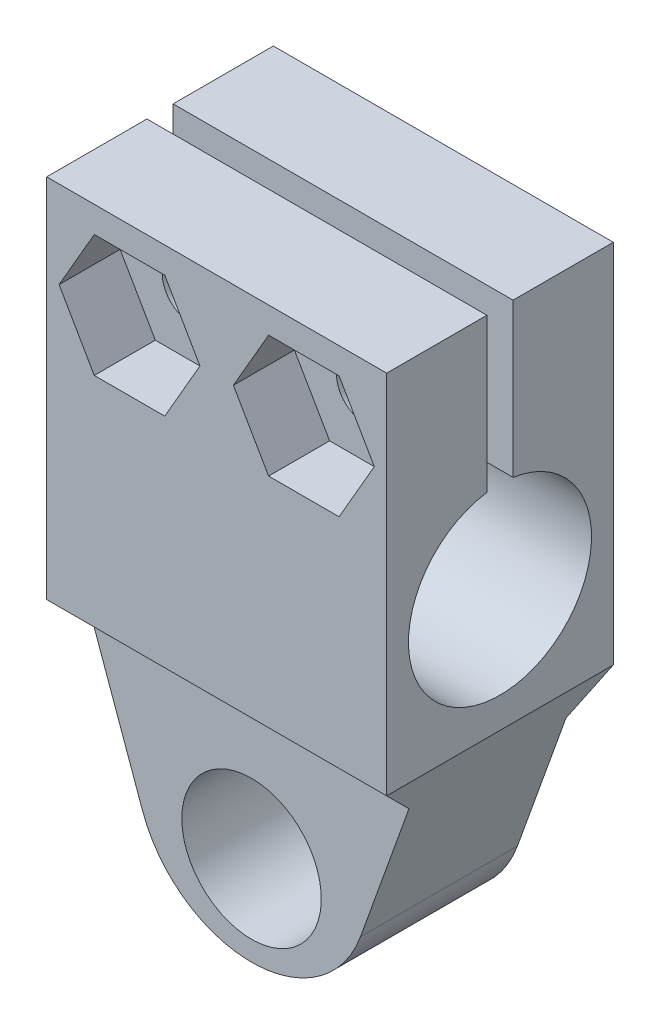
ISO-10303-21;
HEADER;
FILE_DESCRIPTION(('STEP AP214'),'2;1');
FILE_NAME('part.step','',(''),(''),'','','');
FILE_SCHEMA(('AUTOMOTIVE_DESIGN { 1 0 10303 214 1 1 1 1 }'));
ENDSEC;
DATA;
#1=APPLICATION_CONTEXT('core data for automotive mechanical design processes');
#2=APPLICATION_PROTOCOL_DEFINITION('international standard','automotive_design',2000,#1);
#3=PRODUCT_CONTEXT('',#1,'mechanical');
#4=PRODUCT('Part','Part','',(#3));
#5=PRODUCT_RELATED_PRODUCT_CATEGORY('part','',(#4));
#6=PRODUCT_DEFINITION_FORMATION('','',#4);
#7=PRODUCT_DEFINITION_CONTEXT('part definition',#1,'design');
#8=PRODUCT_DEFINITION('design','',#6,#7);
#9=PRODUCT_DEFINITION_SHAPE('','',#8);
#10=(LENGTH_UNIT() NAMED_UNIT(*) SI_UNIT(.MILLI.,.METRE.));
#11=(NAMED_UNIT(*) PLANE_ANGLE_UNIT() SI_UNIT($,.RADIAN.));
#12=(NAMED_UNIT(*) SI_UNIT($,.STERADIAN.) SOLID_ANGLE_UNIT());
#13=UNCERTAINTY_MEASURE_WITH_UNIT(LENGTH_MEASURE(1.E-05),#10,'distance_accuracy_value','');
#14=(GEOMETRIC_REPRESENTATION_CONTEXT(3) GLOBAL_UNCERTAINTY_ASSIGNED_CONTEXT((#13)) GLOBAL_UNIT_ASSIGNED_CONTEXT((#10,
#11,#12)) REPRESENTATION_CONTEXT('',''));
#15=CARTESIAN_POINT('',(0.,0.,0.));
#16=DIRECTION('',(0.,0.,1.));
#17=DIRECTION('',(1.,0.,0.));
#18=AXIS2_PLACEMENT_3D('',#15,#16,#17);
#19=CARTESIAN_POINT('',(9.50000000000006,32.,26.));
#20=DIRECTION('',(0.,0.,-1.));
#21=DIRECTION('',(-0.999999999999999,0.,0.));
#22=AXIS2_PLACEMENT_3D('',#19,#20,#21);
#23=CYLINDRICAL_SURFACE('',#22,3.25);
#24=CARTESIAN_POINT('',(9.50000000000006,32.0000000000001,14.5));
#25=DIRECTION('',(0.,0.,1.));
#26=DIRECTION('',(0.999999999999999,0.,0.));
#27=AXIS2_PLACEMENT_3D('',#24,#25,#26);
#28=CIRCLE('',#27,3.25);
#29=CARTESIAN_POINT('',(6.25000000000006,32.,14.5));
#30=VERTEX_POINT('',#29);
#31=EDGE_CURVE('E314',#30,#30,#28,.T.);
#32=CARTESIAN_POINT('',(9.50000000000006,32.0000000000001,19.));
#33=DIRECTION('',(0.,0.,1.));
#34=DIRECTION('',(0.999999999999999,0.,0.));
#35=AXIS2_PLACEMENT_3D('',#32,#33,#34);
#36=CIRCLE('',#35,3.25);
#37=CARTESIAN_POINT('',(6.25000000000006,32.,19.));
#38=VERTEX_POINT('',#37);
#39=EDGE_CURVE('E242',#38,#38,#36,.F.);
#40=CARTESIAN_POINT('',(6.25000000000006,32.,14.5));
#41=CARTESIAN_POINT('',(6.25000000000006,32.,14.546875));
#42=CARTESIAN_POINT('',(6.25000000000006,32.,14.59375));
#43=CARTESIAN_POINT('',(6.25000000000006,32.,14.6875));
#44=CARTESIAN_POINT('',(6.25000000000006,32.,14.734375));
#45=CARTESIAN_POINT('',(6.25000000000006,32.,14.828125));
#46=CARTESIAN_POINT('',(6.25000000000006,32.,14.875));
#47=CARTESIAN_POINT('',(6.25000000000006,32.,14.96875));
#48=CARTESIAN_POINT('',(6.25000000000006,32.,15.015625));
#49=CARTESIAN_POINT('',(6.25000000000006,32.,15.109375));
#50=CARTESIAN_POINT('',(6.25000000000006,32.,15.15625));
#51=CARTESIAN_POINT('',(6.25000000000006,32.,15.25));
#52=CARTESIAN_POINT('',(6.25000000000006,32.,15.296875));
#53=CARTESIAN_POINT('',(6.25000000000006,32.,15.390625));
#54=CARTESIAN_POINT('',(6.25000000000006,32.,15.4375));
#55=CARTESIAN_POINT('',(6.25000000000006,32.,15.53125));
#56=CARTESIAN_POINT('',(6.25000000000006,32.,15.578125));
#57=CARTESIAN_POINT('',(6.25000000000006,32.,15.671875));
#58=CARTESIAN_POINT('',(6.25000000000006,32.,15.71875));
#59=CARTESIAN_POINT('',(6.25000000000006,32.,15.8125));
#60=CARTESIAN_POINT('',(6.25000000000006,32.,15.859375));
#61=CARTESIAN_POINT('',(6.25000000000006,32.,15.953125));
#62=CARTESIAN_POINT('',(6.25000000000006,32.,16.));
#63=CARTESIAN_POINT('',(6.25000000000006,32.,16.09375));
#64=CARTESIAN_POINT('',(6.25000000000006,32.,16.140625));
#65=CARTESIAN_POINT('',(6.25000000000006,32.,16.234375));
#66=CARTESIAN_POINT('',(6.25000000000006,32.,16.28125));
#67=CARTESIAN_POINT('',(6.25000000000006,32.,16.375));
#68=CARTESIAN_POINT('',(6.25000000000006,32.,16.421875));
#69=CARTESIAN_POINT('',(6.25000000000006,32.,16.515625));
#70=CARTESIAN_POINT('',(6.25000000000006,32.,16.5625));
#71=CARTESIAN_POINT('',(6.25000000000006,32.,16.65625));
#72=CARTESIAN_POINT('',(6.25000000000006,32.,16.703125));
#73=CARTESIAN_POINT('',(6.25000000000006,32.,16.796875));
#74=CARTESIAN_POINT('',(6.25000000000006,32.,16.84375));
#75=CARTESIAN_POINT('',(6.25000000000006,32.,16.9375));
#76=CARTESIAN_POINT('',(6.25000000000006,32.,16.984375));
#77=CARTESIAN_POINT('',(6.25000000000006,32.,17.078125));
#78=CARTESIAN_POINT('',(6.25000000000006,32.,17.125));
#79=CARTESIAN_POINT('',(6.25000000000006,32.,17.21875));
#80=CARTESIAN_POINT('',(6.25000000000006,32.,17.265625));
#81=CARTESIAN_POINT('',(6.25000000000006,32.,17.359375));
#82=CARTESIAN_POINT('',(6.25000000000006,32.,17.40625));
#83=CARTESIAN_POINT('',(6.25000000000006,32.,17.5));
#84=CARTESIAN_POINT('',(6.25000000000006,32.,17.546875));
#85=CARTESIAN_POINT('',(6.25000000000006,32.,17.640625));
#86=CARTESIAN_POINT('',(6.25000000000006,32.,17.6875));
#87=CARTESIAN_POINT('',(6.25000000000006,32.,17.78125));
#88=CARTESIAN_POINT('',(6.25000000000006,32.,17.828125));
#89=CARTESIAN_POINT('',(6.25000000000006,32.,17.921875));
#90=CARTESIAN_POINT('',(6.25000000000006,32.,17.96875));
#91=CARTESIAN_POINT('',(6.25000000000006,32.,18.0625));
#92=CARTESIAN_POINT('',(6.25000000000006,32.,18.109375));
#93=CARTESIAN_POINT('',(6.25000000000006,32.,18.203125));
#94=CARTESIAN_POINT('',(6.25000000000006,32.,18.25));
#95=CARTESIAN_POINT('',(6.25000000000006,32.,18.34375));
#96=CARTESIAN_POINT('',(6.25000000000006,32.,18.390625));
#97=CARTESIAN_POINT('',(6.25000000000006,32.,18.484375));
#98=CARTESIAN_POINT('',(6.25000000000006,32.,18.53125));
#99=CARTESIAN_POINT('',(6.25000000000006,32.,18.625));
#100=CARTESIAN_POINT('',(6.25000000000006,32.,18.671875));
#101=CARTESIAN_POINT('',(6.25000000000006,32.,18.765625));
#102=CARTESIAN_POINT('',(6.25000000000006,32.,18.8125));
#103=CARTESIAN_POINT('',(6.25000000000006,32.,18.90625));
#104=CARTESIAN_POINT('',(6.25000000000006,32.,18.953125));
#105=CARTESIAN_POINT('',(6.25000000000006,32.,19.));
#106=B_SPLINE_CURVE_WITH_KNOTS('',3,(#40,#41,#42,#43,#44,#45,#46,#47,#48,#49,#50,#51,#52,#53,
#54,#55,#56,#57,#58,#59,#60,#61,#62,#63,#64,#65,#66,#67,#68,#69,#70,#71,#72,#73,#74,#75,#76,#77,
#78,#79,#80,#81,#82,#83,#84,#85,#86,#87,#88,#89,#90,#91,#92,#93,#94,#95,#96,#97,#98,#99,#100,
#101,#102,#103,#104,#105),.UNSPECIFIED.,.F.,.F.,(4,2,2,2,2,2,2,2,2,2,2,2,2,2,2,2,2,2,2,2,2,2,2,
2,2,2,2,2,2,2,2,2,4),(0.,0.140625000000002,0.281250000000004,0.421875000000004,
0.562500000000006,0.703125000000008,0.843750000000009,0.98437500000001,1.12500000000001,
1.26562500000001,1.40625000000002,1.54687500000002,1.68750000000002,1.82812500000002,
1.96875000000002,2.10937500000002,2.25000000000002,2.39062500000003,2.53125000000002,
2.67187500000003,2.81250000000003,2.95312500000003,3.09375000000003,3.23437500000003,
3.37500000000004,3.51562500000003,3.65625000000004,3.79687500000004,3.93750000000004,
4.07812500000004,4.21875000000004,4.35937500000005,4.50000000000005),.UNSPECIFIED.);
#107=EDGE_CURVE('BSEAM28',#30,#38,#106,.T.);
#108=ORIENTED_EDGE('',*,*,#31,.F.);
#109=ORIENTED_EDGE('',*,*,#39,.F.);
#110=ORIENTED_EDGE('',*,*,#107,.T.);
#111=ORIENTED_EDGE('',*,*,#107,.F.);
#112=EDGE_LOOP('',(#108,#110,#109,#111));
#113=FACE_BOUND('',#112,.T.);
#114=ADVANCED_FACE('F28',(#113),#23,.F.);
#115=CARTESIAN_POINT('',(29.5000000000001,32.,26.));
#116=DIRECTION('',(0.,0.,-1.));
#117=DIRECTION('',(-0.999999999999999,0.,0.));
#118=AXIS2_PLACEMENT_3D('',#115,#116,#117);
#119=CYLINDRICAL_SURFACE('',#118,3.25);
#120=CARTESIAN_POINT('',(29.5000000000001,32.0000000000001,14.5));
#121=DIRECTION('',(0.,0.,1.));
#122=DIRECTION('',(0.999999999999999,0.,0.));
#123=AXIS2_PLACEMENT_3D('',#120,#121,#122);
#124=CIRCLE('',#123,3.25);
#125=CARTESIAN_POINT('',(26.2500000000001,32.,14.5));
#126=VERTEX_POINT('',#125);
#127=EDGE_CURVE('E313',#126,#126,#124,.T.);
#128=CARTESIAN_POINT('',(29.5000000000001,32.0000000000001,19.));
#129=DIRECTION('',(0.,0.,1.));
#130=DIRECTION('',(0.999999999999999,0.,0.));
#131=AXIS2_PLACEMENT_3D('',#128,#129,#130);
#132=CIRCLE('',#131,3.25);
#133=CARTESIAN_POINT('',(26.2500000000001,32.,19.));
#134=VERTEX_POINT('',#133);
#135=EDGE_CURVE('E286',#134,#134,#132,.F.);
#136=CARTESIAN_POINT('',(26.2500000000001,32.,14.5));
#137=CARTESIAN_POINT('',(26.2500000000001,32.,14.546875));
#138=CARTESIAN_POINT('',(26.2500000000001,32.,14.59375));
#139=CARTESIAN_POINT('',(26.2500000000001,32.,14.6875));
#140=CARTESIAN_POINT('',(26.2500000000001,32.,14.734375));
#141=CARTESIAN_POINT('',(26.2500000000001,32.,14.828125));
#142=CARTESIAN_POINT('',(26.2500000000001,32.,14.875));
#143=CARTESIAN_POINT('',(26.2500000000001,32.,14.96875));
#144=CARTESIAN_POINT('',(26.2500000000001,32.,15.015625));
#145=CARTESIAN_POINT('',(26.2500000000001,32.,15.109375));
#146=CARTESIAN_POINT('',(26.2500000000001,32.,15.15625));
#147=CARTESIAN_POINT('',(26.2500000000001,32.,15.25));
#148=CARTESIAN_POINT('',(26.2500000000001,32.,15.296875));
#149=CARTESIAN_POINT('',(26.2500000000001,32.,15.390625));
#150=CARTESIAN_POINT('',(26.2500000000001,32.,15.4375));
#151=CARTESIAN_POINT('',(26.2500000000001,32.,15.53125));
#152=CARTESIAN_POINT('',(26.2500000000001,32.,15.578125));
#153=CARTESIAN_POINT('',(26.2500000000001,32.,15.671875));
#154=CARTESIAN_POINT('',(26.2500000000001,32.,15.71875));
#155=CARTESIAN_POINT('',(26.2500000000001,32.,15.8125));
#156=CARTESIAN_POINT('',(26.2500000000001,32.,15.859375));
#157=CARTESIAN_POINT('',(26.2500000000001,32.,15.953125));
#158=CARTESIAN_POINT('',(26.2500000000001,32.,16.));
#159=CARTESIAN_POINT('',(26.2500000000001,32.,16.09375));
#160=CARTESIAN_POINT('',(26.2500000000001,32.,16.140625));
#161=CARTESIAN_POINT('',(26.2500000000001,32.,16.234375));
#162=CARTESIAN_POINT('',(26.2500000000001,32.,16.28125));
#163=CARTESIAN_POINT('',(26.2500000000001,32.,16.375));
#164=CARTESIAN_POINT('',(26.2500000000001,32.,16.421875));
#165=CARTESIAN_POINT('',(26.2500000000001,32.,16.515625));
#166=CARTESIAN_POINT('',(26.2500000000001,32.,16.5625));
#167=CARTESIAN_POINT('',(26.2500000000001,32.,16.65625));
#168=CARTESIAN_POINT('',(26.2500000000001,32.,16.703125));
#169=CARTESIAN_POINT('',(26.2500000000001,32.,16.796875));
#170=CARTESIAN_POINT('',(26.2500000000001,32.,16.84375));
#171=CARTESIAN_POINT('',(26.2500000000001,32.,16.9375));
#172=CARTESIAN_POINT('',(26.2500000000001,32.,16.984375));
#173=CARTESIAN_POINT('',(26.2500000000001,32.,17.078125));
#174=CARTESIAN_POINT('',(26.2500000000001,32.,17.125));
#175=CARTESIAN_POINT('',(26.2500000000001,32.,17.21875));
#176=CARTESIAN_POINT('',(26.2500000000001,32.,17.265625));
#177=CARTESIAN_POINT('',(26.2500000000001,32.,17.359375));
#178=CARTESIAN_POINT('',(26.2500000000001,32.,17.40625));
#179=CARTESIAN_POINT('',(26.2500000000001,32.,17.5));
#180=CARTESIAN_POINT('',(26.2500000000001,32.,17.546875));
#181=CARTESIAN_POINT('',(26.2500000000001,32.,17.640625));
#182=CARTESIAN_POINT('',(26.2500000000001,32.,17.6875));
#183=CARTESIAN_POINT('',(26.2500000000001,32.,17.78125));
#184=CARTESIAN_POINT('',(26.2500000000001,32.,17.828125));
#185=CARTESIAN_POINT('',(26.2500000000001,32.,17.921875));
#186=CARTESIAN_POINT('',(26.2500000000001,32.,17.96875));
#187=CARTESIAN_POINT('',(26.2500000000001,32.,18.0625));
#188=CARTESIAN_POINT('',(26.2500000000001,32.,18.109375));
#189=CARTESIAN_POINT('',(26.2500000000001,32.,18.203125));
#190=CARTESIAN_POINT('',(26.2500000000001,32.,18.25));
#191=CARTESIAN_POINT('',(26.2500000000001,32.,18.34375));
#192=CARTESIAN_POINT('',(26.2500000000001,32.,18.390625));
#193=CARTESIAN_POINT('',(26.2500000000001,32.,18.484375));
#194=CARTESIAN_POINT('',(26.2500000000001,32.,18.53125));
#195=CARTESIAN_POINT('',(26.2500000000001,32.,18.625));
#196=CARTESIAN_POINT('',(26.2500000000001,32.,18.671875));
#197=CARTESIAN_POINT('',(26.2500000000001,32.,18.765625));
#198=CARTESIAN_POINT('',(26.2500000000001,32.,18.8125));
#199=CARTESIAN_POINT('',(26.2500000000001,32.,18.90625));
#200=CARTESIAN_POINT('',(26.2500000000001,32.,18.953125));
#201=CARTESIAN_POINT('',(26.2500000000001,32.,19.));
#202=B_SPLINE_CURVE_WITH_KNOTS('',3,(#136,#137,#138,#139,#140,#141,#142,#143,#144,#145,#146,
#147,#148,#149,#150,#151,#152,#153,#154,#155,#156,#157,#158,#159,#160,#161,#162,#163,#164,#165,
#166,#167,#168,#169,#170,#171,#172,#173,#174,#175,#176,#177,#178,#179,#180,#181,#182,#183,#184,
#185,#186,#187,#188,#189,#190,#191,#192,#193,#194,#195,#196,#197,#198,#199,#200,#201),
.UNSPECIFIED.,.F.,.F.,(4,2,2,2,2,2,2,2,2,2,2,2,2,2,2,2,2,2,2,2,2,2,2,2,2,2,2,2,2,2,2,2,4),(0.,
0.140625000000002,0.281250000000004,0.421875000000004,0.562500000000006,0.703125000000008,
0.843750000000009,0.98437500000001,1.12500000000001,1.26562500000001,1.40625000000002,
1.54687500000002,1.68750000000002,1.82812500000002,1.96875000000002,2.10937500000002,
2.25000000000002,2.39062500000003,2.53125000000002,2.67187500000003,2.81250000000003,
2.95312500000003,3.09375000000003,3.23437500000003,3.37500000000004,3.51562500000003,
3.65625000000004,3.79687500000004,3.93750000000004,4.07812500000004,4.21875000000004,
4.35937500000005,4.50000000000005),.UNSPECIFIED.);
#203=EDGE_CURVE('BSEAM433',#126,#134,#202,.T.);
#204=ORIENTED_EDGE('',*,*,#127,.F.);
#205=ORIENTED_EDGE('',*,*,#135,.F.);
#206=ORIENTED_EDGE('',*,*,#203,.T.);
#207=ORIENTED_EDGE('',*,*,#203,.F.);
#208=EDGE_LOOP('',(#204,#206,#205,#207));
#209=FACE_BOUND('',#208,.T.);
#210=ADVANCED_FACE('F433',(#209),#119,.F.);
#211=CARTESIAN_POINT('',(9.50000000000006,32.0000000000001,11.5));
#212=DIRECTION('',(0.,0.,-1.));
#213=DIRECTION('',(-0.999999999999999,0.,0.));
#214=AXIS2_PLACEMENT_3D('',#211,#212,#213);
#215=CIRCLE('',#214,3.25);
#216=CARTESIAN_POINT('',(6.25000000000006,32.,11.5));
#217=VERTEX_POINT('',#216);
#218=EDGE_CURVE('E310',#217,#217,#215,.T.);
#219=CARTESIAN_POINT('',(9.50000000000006,32.,6.99999999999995));
#220=DIRECTION('',(0.,0.,-1.));
#221=DIRECTION('',(-0.999999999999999,0.,0.));
#222=AXIS2_PLACEMENT_3D('',#219,#220,#221);
#223=CIRCLE('',#222,3.25);
#224=CARTESIAN_POINT('',(6.25000000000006,32.,6.99999999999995));
#225=VERTEX_POINT('',#224);
#226=EDGE_CURVE('E302',#225,#225,#223,.F.);
#227=CARTESIAN_POINT('',(6.25000000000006,32.,11.5));
#228=CARTESIAN_POINT('',(6.25000000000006,32.,11.453125));
#229=CARTESIAN_POINT('',(6.25000000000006,32.,11.40625));
#230=CARTESIAN_POINT('',(6.25000000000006,32.,11.3125));
#231=CARTESIAN_POINT('',(6.25000000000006,32.,11.265625));
#232=CARTESIAN_POINT('',(6.25000000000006,32.,11.171875));
#233=CARTESIAN_POINT('',(6.25000000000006,32.,11.125));
#234=CARTESIAN_POINT('',(6.25000000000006,32.,11.03125));
#235=CARTESIAN_POINT('',(6.25000000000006,32.,10.984375));
#236=CARTESIAN_POINT('',(6.25000000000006,32.,10.890625));
#237=CARTESIAN_POINT('',(6.25000000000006,32.,10.84375));
#238=CARTESIAN_POINT('',(6.25000000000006,32.,10.75));
#239=CARTESIAN_POINT('',(6.25000000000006,32.,10.703125));
#240=CARTESIAN_POINT('',(6.25000000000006,32.,10.609375));
#241=CARTESIAN_POINT('',(6.25000000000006,32.,10.5625));
#242=CARTESIAN_POINT('',(6.25000000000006,32.,10.46875));
#243=CARTESIAN_POINT('',(6.25000000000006,32.,10.421875));
#244=CARTESIAN_POINT('',(6.25000000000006,32.,10.328125));
#245=CARTESIAN_POINT('',(6.25000000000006,32.,10.28125));
#246=CARTESIAN_POINT('',(6.25000000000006,32.,10.1875));
#247=CARTESIAN_POINT('',(6.25000000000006,32.,10.140625));
#248=CARTESIAN_POINT('',(6.25000000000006,32.,10.046875));
#249=CARTESIAN_POINT('',(6.25000000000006,32.,9.99999999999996));
#250=CARTESIAN_POINT('',(6.25000000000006,32.,9.90624999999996));
#251=CARTESIAN_POINT('',(6.25000000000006,32.,9.85937499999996));
#252=CARTESIAN_POINT('',(6.25000000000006,32.,9.76562499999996));
#253=CARTESIAN_POINT('',(6.25000000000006,32.,9.71874999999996));
#254=CARTESIAN_POINT('',(6.25000000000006,32.,9.62499999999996));
#255=CARTESIAN_POINT('',(6.25000000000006,32.,9.57812499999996));
#256=CARTESIAN_POINT('',(6.25000000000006,32.,9.48437499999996));
#257=CARTESIAN_POINT('',(6.25000000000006,32.,9.43749999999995));
#258=CARTESIAN_POINT('',(6.25000000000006,32.,9.34374999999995));
#259=CARTESIAN_POINT('',(6.25000000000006,32.,9.29687499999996));
#260=CARTESIAN_POINT('',(6.25000000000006,32.,9.20312499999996));
#261=CARTESIAN_POINT('',(6.25000000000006,32.,9.15624999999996));
#262=CARTESIAN_POINT('',(6.25000000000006,32.,9.06249999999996));
#263=CARTESIAN_POINT('',(6.25000000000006,32.,9.01562499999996));
#264=CARTESIAN_POINT('',(6.25000000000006,32.,8.92187499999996));
#265=CARTESIAN_POINT('',(6.25000000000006,32.,8.87499999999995));
#266=CARTESIAN_POINT('',(6.25000000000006,32.,8.78124999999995));
#267=CARTESIAN_POINT('',(6.25000000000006,32.,8.73437499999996));
#268=CARTESIAN_POINT('',(6.25000000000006,32.,8.64062499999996));
#269=CARTESIAN_POINT('',(6.25000000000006,32.,8.59374999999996));
#270=CARTESIAN_POINT('',(6.25000000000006,32.,8.49999999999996));
#271=CARTESIAN_POINT('',(6.25000000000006,32.,8.45312499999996));
#272=CARTESIAN_POINT('',(6.25000000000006,32.,8.35937499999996));
#273=CARTESIAN_POINT('',(6.25000000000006,32.,8.31249999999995));
#274=CARTESIAN_POINT('',(6.25000000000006,32.,8.21874999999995));
#275=CARTESIAN_POINT('',(6.25000000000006,32.,8.17187499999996));
#276=CARTESIAN_POINT('',(6.25000000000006,32.,8.07812499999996));
#277=CARTESIAN_POINT('',(6.25000000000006,32.,8.03124999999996));
#278=CARTESIAN_POINT('',(6.25000000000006,32.,7.93749999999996));
#279=CARTESIAN_POINT('',(6.25000000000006,32.,7.89062499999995));
#280=CARTESIAN_POINT('',(6.25000000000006,32.,7.79687499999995));
#281=CARTESIAN_POINT('',(6.25000000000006,32.,7.74999999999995));
#282=CARTESIAN_POINT('',(6.25000000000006,32.,7.65624999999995));
#283=CARTESIAN_POINT('',(6.25000000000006,32.,7.60937499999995));
#284=CARTESIAN_POINT('',(6.25000000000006,32.,7.51562499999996));
#285=CARTESIAN_POINT('',(6.25000000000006,32.,7.46874999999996));
#286=CARTESIAN_POINT('',(6.25000000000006,32.,7.37499999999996));
#287=CARTESIAN_POINT('',(6.25000000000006,32.,7.32812499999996));
#288=CARTESIAN_POINT('',(6.25000000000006,32.,7.23437499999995));
#289=CARTESIAN_POINT('',(6.25000000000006,32.,7.18749999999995));
#290=CARTESIAN_POINT('',(6.25000000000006,32.,7.09374999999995));
#291=CARTESIAN_POINT('',(6.25000000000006,32.,7.04687499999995));
#292=CARTESIAN_POINT('',(6.25000000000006,32.,6.99999999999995));
#293=B_SPLINE_CURVE_WITH_KNOTS('',3,(#227,#228,#229,#230,#231,#232,#233,#234,#235,#236,#237,
#238,#239,#240,#241,#242,#243,#244,#245,#246,#247,#248,#249,#250,#251,#252,#253,#254,#255,#256,
#257,#258,#259,#260,#261,#262,#263,#264,#265,#266,#267,#268,#269,#270,#271,#272,#273,#274,#275,
#276,#277,#278,#279,#280,#281,#282,#283,#284,#285,#286,#287,#288,#289,#290,#291,#292),
.UNSPECIFIED.,.F.,.F.,(4,2,2,2,2,2,2,2,2,2,2,2,2,2,2,2,2,2,2,2,2,2,2,2,2,2,2,2,2,2,2,2,4),(0.,
0.140625,0.28125,0.421875,0.5625,0.703125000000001,0.843750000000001,0.984375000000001,1.125,
1.265625,1.40625,1.546875,1.6875,1.828125,1.96875,2.109375,2.25,2.390625,2.53125,2.671875,
2.8125,2.953125,3.09375,3.234375,3.375,3.515625,3.65625,3.796875,3.9375,4.078125,4.21875,
4.359375,4.5),.UNSPECIFIED.);
#294=EDGE_CURVE('BSEAM436',#217,#225,#293,.T.);
#295=ORIENTED_EDGE('',*,*,#218,.F.);
#296=ORIENTED_EDGE('',*,*,#226,.F.);
#297=ORIENTED_EDGE('',*,*,#294,.T.);
#298=ORIENTED_EDGE('',*,*,#294,.F.);
#299=EDGE_LOOP('',(#295,#297,#296,#298));
#300=FACE_BOUND('',#299,.T.);
#301=ADVANCED_FACE('F436',(#300),#23,.F.);
#302=CARTESIAN_POINT('',(29.5000000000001,32.0000000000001,11.5));
#303=DIRECTION('',(0.,0.,-1.));
#304=DIRECTION('',(-0.999999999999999,0.,0.));
#305=AXIS2_PLACEMENT_3D('',#302,#303,#304);
#306=CIRCLE('',#305,3.25);
#307=CARTESIAN_POINT('',(26.2500000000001,32.,11.5));
#308=VERTEX_POINT('',#307);
#309=EDGE_CURVE('E315',#308,#308,#306,.T.);
#310=CARTESIAN_POINT('',(29.5000000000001,32.,6.99999999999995));
#311=DIRECTION('',(0.,0.,-1.));
#312=DIRECTION('',(-0.999999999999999,0.,0.));
#313=AXIS2_PLACEMENT_3D('',#310,#311,#312);
#314=CIRCLE('',#313,3.25);
#315=CARTESIAN_POINT('',(26.2500000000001,32.,6.99999999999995));
#316=VERTEX_POINT('',#315);
#317=EDGE_CURVE('E309',#316,#316,#314,.F.);
#318=CARTESIAN_POINT('',(26.2500000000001,32.,11.5));
#319=CARTESIAN_POINT('',(26.2500000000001,32.,11.453125));
#320=CARTESIAN_POINT('',(26.2500000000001,32.,11.40625));
#321=CARTESIAN_POINT('',(26.2500000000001,32.,11.3125));
#322=CARTESIAN_POINT('',(26.2500000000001,32.,11.265625));
#323=CARTESIAN_POINT('',(26.2500000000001,32.,11.171875));
#324=CARTESIAN_POINT('',(26.2500000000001,32.,11.125));
#325=CARTESIAN_POINT('',(26.2500000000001,32.,11.03125));
#326=CARTESIAN_POINT('',(26.2500000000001,32.,10.984375));
#327=CARTESIAN_POINT('',(26.2500000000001,32.,10.890625));
#328=CARTESIAN_POINT('',(26.2500000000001,32.,10.84375));
#329=CARTESIAN_POINT('',(26.2500000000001,32.,10.75));
#330=CARTESIAN_POINT('',(26.2500000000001,32.,10.703125));
#331=CARTESIAN_POINT('',(26.2500000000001,32.,10.609375));
#332=CARTESIAN_POINT('',(26.2500000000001,32.,10.5625));
#333=CARTESIAN_POINT('',(26.2500000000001,32.,10.46875));
#334=CARTESIAN_POINT('',(26.2500000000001,32.,10.421875));
#335=CARTESIAN_POINT('',(26.2500000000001,32.,10.328125));
#336=CARTESIAN_POINT('',(26.2500000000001,32.,10.28125));
#337=CARTESIAN_POINT('',(26.2500000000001,32.,10.1875));
#338=CARTESIAN_POINT('',(26.2500000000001,32.,10.140625));
#339=CARTESIAN_POINT('',(26.2500000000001,32.,10.046875));
#340=CARTESIAN_POINT('',(26.2500000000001,32.,9.99999999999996));
#341=CARTESIAN_POINT('',(26.2500000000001,32.,9.90624999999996));
#342=CARTESIAN_POINT('',(26.2500000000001,32.,9.85937499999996));
#343=CARTESIAN_POINT('',(26.2500000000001,32.,9.76562499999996));
#344=CARTESIAN_POINT('',(26.2500000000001,32.,9.71874999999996));
#345=CARTESIAN_POINT('',(26.2500000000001,32.,9.62499999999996));
#346=CARTESIAN_POINT('',(26.2500000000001,32.,9.57812499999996));
#347=CARTESIAN_POINT('',(26.2500000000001,32.,9.48437499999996));
#348=CARTESIAN_POINT('',(26.2500000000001,32.,9.43749999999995));
#349=CARTESIAN_POINT('',(26.2500000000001,32.,9.34374999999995));
#350=CARTESIAN_POINT('',(26.2500000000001,32.,9.29687499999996));
#351=CARTESIAN_POINT('',(26.2500000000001,32.,9.20312499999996));
#352=CARTESIAN_POINT('',(26.2500000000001,32.,9.15624999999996));
#353=CARTESIAN_POINT('',(26.2500000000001,32.,9.06249999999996));
#354=CARTESIAN_POINT('',(26.2500000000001,32.,9.01562499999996));
#355=CARTESIAN_POINT('',(26.2500000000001,32.,8.92187499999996));
#356=CARTESIAN_POINT('',(26.2500000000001,32.,8.87499999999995));
#357=CARTESIAN_POINT('',(26.2500000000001,32.,8.78124999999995));
#358=CARTESIAN_POINT('',(26.2500000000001,32.,8.73437499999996));
#359=CARTESIAN_POINT('',(26.2500000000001,32.,8.64062499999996));
#360=CARTESIAN_POINT('',(26.2500000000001,32.,8.59374999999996));
#361=CARTESIAN_POINT('',(26.2500000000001,32.,8.49999999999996));
#362=CARTESIAN_POINT('',(26.2500000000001,32.,8.45312499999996));
#363=CARTESIAN_POINT('',(26.2500000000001,32.,8.35937499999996));
#364=CARTESIAN_POINT('',(26.2500000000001,32.,8.31249999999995));
#365=CARTESIAN_POINT('',(26.2500000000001,32.,8.21874999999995));
#366=CARTESIAN_POINT('',(26.2500000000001,32.,8.17187499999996));
#367=CARTESIAN_POINT('',(26.2500000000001,32.,8.07812499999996));
#368=CARTESIAN_POINT('',(26.2500000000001,32.,8.03124999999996));
#369=CARTESIAN_POINT('',(26.2500000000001,32.,7.93749999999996));
#370=CARTESIAN_POINT('',(26.2500000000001,32.,7.89062499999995));
#371=CARTESIAN_POINT('',(26.2500000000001,32.,7.79687499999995));
#372=CARTESIAN_POINT('',(26.2500000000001,32.,7.74999999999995));
#373=CARTESIAN_POINT('',(26.2500000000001,32.,7.65624999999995));
#374=CARTESIAN_POINT('',(26.2500000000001,32.,7.60937499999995));
#375=CARTESIAN_POINT('',(26.2500000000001,32.,7.51562499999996));
#376=CARTESIAN_POINT('',(26.2500000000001,32.,7.46874999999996));
#377=CARTESIAN_POINT('',(26.2500000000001,32.,7.37499999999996));
#378=CARTESIAN_POINT('',(26.2500000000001,32.,7.32812499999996));
#379=CARTESIAN_POINT('',(26.2500000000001,32.,7.23437499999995));
#380=CARTESIAN_POINT('',(26.2500000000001,32.,7.18749999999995));
#381=CARTESIAN_POINT('',(26.2500000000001,32.,7.09374999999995));
#382=CARTESIAN_POINT('',(26.2500000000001,32.,7.04687499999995));
#383=CARTESIAN_POINT('',(26.2500000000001,32.,6.99999999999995));
#384=B_SPLINE_CURVE_WITH_KNOTS('',3,(#318,#319,#320,#321,#322,#323,#324,#325,#326,#327,#328,
#329,#330,#331,#332,#333,#334,#335,#336,#337,#338,#339,#340,#341,#342,#343,#344,#345,#346,#347,
#348,#349,#350,#351,#352,#353,#354,#355,#356,#357,#358,#359,#360,#361,#362,#363,#364,#365,#366,
#367,#368,#369,#370,#371,#372,#373,#374,#375,#376,#377,#378,#379,#380,#381,#382,#383),
.UNSPECIFIED.,.F.,.F.,(4,2,2,2,2,2,2,2,2,2,2,2,2,2,2,2,2,2,2,2,2,2,2,2,2,2,2,2,2,2,2,2,4),(0.,
0.140625,0.28125,0.421875,0.5625,0.703125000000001,0.843750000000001,0.984375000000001,1.125,
1.265625,1.40625,1.546875,1.6875,1.828125,1.96875,2.109375,2.25,2.390625,2.53125,2.671875,
2.8125,2.953125,3.09375,3.234375,3.375,3.515625,3.65625,3.796875,3.9375,4.078125,4.21875,
4.359375,4.5),.UNSPECIFIED.);
#385=EDGE_CURVE('BSEAM442',#308,#316,#384,.T.);
#386=ORIENTED_EDGE('',*,*,#309,.F.);
#387=ORIENTED_EDGE('',*,*,#317,.F.);
#388=ORIENTED_EDGE('',*,*,#385,.T.);
#389=ORIENTED_EDGE('',*,*,#385,.F.);
#390=EDGE_LOOP('',(#386,#388,#387,#389));
#391=FACE_BOUND('',#390,.T.);
#392=ADVANCED_FACE('F442',(#391),#119,.F.);
#393=CARTESIAN_POINT('',(0.,42.,26.));
#394=DIRECTION('',(0.,-1.,0.));
#395=DIRECTION('',(0.,0.,-1.));
#396=AXIS2_PLACEMENT_3D('',#393,#394,#395);
#397=PLANE('',#396);
#398=DIRECTION('',(0.,0.,-1.));
#399=VECTOR('',#398,1.);
#400=CARTESIAN_POINT('',(0.,42.,26.));
#401=LINE('',#400,#399);
#402=CARTESIAN_POINT('',(0.,42.0000000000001,11.5));
#403=VERTEX_POINT('',#402);
#404=CARTESIAN_POINT('',(0.,42.0000000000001,0.));
#405=VERTEX_POINT('',#404);
#406=EDGE_CURVE('E390',#403,#405,#401,.T.);
#407=ORIENTED_EDGE('',*,*,#406,.F.);
#408=DIRECTION('',(0.999999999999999,0.,0.));
#409=VECTOR('',#408,1.);
#410=CARTESIAN_POINT('',(0.,42.0000000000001,11.5));
#411=LINE('',#410,#409);
#412=CARTESIAN_POINT('',(38.9999999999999,42.0000000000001,11.5));
#413=VERTEX_POINT('',#412);
#414=EDGE_CURVE('E11',#403,#413,#411,.T.);
#415=ORIENTED_EDGE('',*,*,#414,.T.);
#416=DIRECTION('',(0.,0.,-1.));
#417=VECTOR('',#416,1.);
#418=CARTESIAN_POINT('',(38.9999999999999,42.,26.));
#419=LINE('',#418,#417);
#420=CARTESIAN_POINT('',(38.9999999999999,42.0000000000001,0.));
#421=VERTEX_POINT('',#420);
#422=EDGE_CURVE('E394',#413,#421,#419,.T.);
#423=ORIENTED_EDGE('',*,*,#422,.T.);
#424=DIRECTION('',(-0.999999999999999,0.,0.));
#425=VECTOR('',#424,1.);
#426=CARTESIAN_POINT('',(0.,42.0000000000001,0.));
#427=LINE('',#426,#425);
#428=EDGE_CURVE('E380',#421,#405,#427,.T.);
#429=ORIENTED_EDGE('',*,*,#428,.T.);
#430=EDGE_LOOP('',(#407,#415,#423,#429));
#431=FACE_BOUND('',#430,.T.);
#432=ADVANCED_FACE('F450',(#431),#397,.F.);
#433=CARTESIAN_POINT('',(0.,0.,26.));
#434=DIRECTION('',(0.999999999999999,0.,0.));
#435=DIRECTION('',(0.,0.,-1.));
#436=AXIS2_PLACEMENT_3D('',#433,#434,#435);
#437=PLANE('',#436);
#438=CARTESIAN_POINT('',(0.,14.0000000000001,13.));
#439=DIRECTION('',(0.999999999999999,0.,0.));
#440=DIRECTION('',(0.,0.,-1.));
#441=AXIS2_PLACEMENT_3D('',#438,#439,#440);
#442=CIRCLE('',#441,10.5);
#443=CARTESIAN_POINT('',(0.,24.3923048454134,14.5));
#444=VERTEX_POINT('',#443);
#445=CARTESIAN_POINT('',(0.,24.3923048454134,11.5));
#446=VERTEX_POINT('',#445);
#447=EDGE_CURVE('E331',#444,#446,#442,.T.);
#448=ORIENTED_EDGE('',*,*,#447,.T.);
#449=DIRECTION('',(0.,1.,0.));
#450=VECTOR('',#449,1.);
#451=CARTESIAN_POINT('',(0.,24.3923048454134,11.5));
#452=LINE('',#451,#450);
#453=EDGE_CURVE('E325',#446,#403,#452,.T.);
#454=ORIENTED_EDGE('',*,*,#453,.T.);
#455=ORIENTED_EDGE('',*,*,#406,.T.);
#456=DIRECTION('',(0.,-1.,0.));
#457=VECTOR('',#456,1.);
#458=CARTESIAN_POINT('',(0.,0.,0.));
#459=LINE('',#458,#457);
#460=CARTESIAN_POINT('',(0.,0.,0.));
#461=VERTEX_POINT('',#460);
#462=EDGE_CURVE('E374',#405,#461,#459,.T.);
#463=ORIENTED_EDGE('',*,*,#462,.T.);
#464=DIRECTION('',(0.,0.,-1.));
#465=VECTOR('',#464,1.);
#466=CARTESIAN_POINT('',(0.,0.,26.));
#467=LINE('',#466,#465);
#468=CARTESIAN_POINT('',(0.,0.,26.));
#469=VERTEX_POINT('',#468);
#470=EDGE_CURVE('E407',#469,#461,#467,.T.);
#471=ORIENTED_EDGE('',*,*,#470,.F.);
#472=DIRECTION('',(0.,-1.,0.));
#473=VECTOR('',#472,1.);
#474=CARTESIAN_POINT('',(0.,0.,26.));
#475=LINE('',#474,#473);
#476=CARTESIAN_POINT('',(0.,42.,26.));
#477=VERTEX_POINT('',#476);
#478=EDGE_CURVE('E383',#477,#469,#475,.T.);
#479=ORIENTED_EDGE('',*,*,#478,.F.);
#480=CARTESIAN_POINT('',(0.,42.0000000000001,14.5));
#481=VERTEX_POINT('',#480);
#482=EDGE_CURVE('E391',#477,#481,#401,.T.);
#483=ORIENTED_EDGE('',*,*,#482,.T.);
#484=DIRECTION('',(0.,-1.,0.));
#485=VECTOR('',#484,1.);
#486=CARTESIAN_POINT('',(0.,24.3923048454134,14.5));
#487=LINE('',#486,#485);
#488=EDGE_CURVE('E328',#481,#444,#487,.T.);
#489=ORIENTED_EDGE('',*,*,#488,.T.);
#490=EDGE_LOOP('',(#448,#454,#455,#463,#471,#479,#483,#489));
#491=FACE_BOUND('',#490,.T.);
#492=ADVANCED_FACE('F30',(#491),#437,.F.);
#493=CARTESIAN_POINT('',(0.,0.,26.));
#494=DIRECTION('',(0.94113721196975,0.338024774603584,0.));
#495=DIRECTION('',(-0.338024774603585,0.941137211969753,0.));
#496=AXIS2_PLACEMENT_3D('',#493,#494,#495);
#497=PLANE('',#496);
#498=DIRECTION('',(-0.338024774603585,0.941137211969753,0.));
#499=VECTOR('',#498,1.);
#500=CARTESIAN_POINT('',(0.,0.,22.));
#501=LINE('',#500,#499);
#502=CARTESIAN_POINT('',(6.9999999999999,-19.4895788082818,22.));
#503=VERTEX_POINT('',#502);
#504=CARTESIAN_POINT('',(1.43666521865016,-4.,22.));
#505=VERTEX_POINT('',#504);
#506=EDGE_CURVE('E371',#503,#505,#501,.T.);
#507=ORIENTED_EDGE('',*,*,#506,.T.);
#508=DIRECTION('',(-0.246154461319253,0.685349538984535,0.685349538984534));
#509=VECTOR('',#508,1.);
#510=CARTESIAN_POINT('',(0.,0.,26.));
#511=LINE('',#510,#509);
#512=EDGE_CURVE('E359',#505,#469,#511,.T.);
#513=ORIENTED_EDGE('',*,*,#512,.T.);
#514=ORIENTED_EDGE('',*,*,#470,.T.);
#515=DIRECTION('',(0.246154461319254,-0.685349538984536,0.685349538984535));
#516=VECTOR('',#515,1.);
#517=CARTESIAN_POINT('',(4.38624801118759,-12.2123037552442,12.2123037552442));
#518=LINE('',#517,#516);
#519=CARTESIAN_POINT('',(1.43666521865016,-3.99999999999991,4.00000000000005));
#520=VERTEX_POINT('',#519);
#521=EDGE_CURVE('E353',#461,#520,#518,.T.);
#522=ORIENTED_EDGE('',*,*,#521,.T.);
#523=DIRECTION('',(0.338024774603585,-0.941137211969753,0.));
#524=VECTOR('',#523,1.);
#525=CARTESIAN_POINT('',(0.,0.,4.));
#526=LINE('',#525,#524);
#527=CARTESIAN_POINT('',(6.9999999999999,-19.4895788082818,4.));
#528=VERTEX_POINT('',#527);
#529=EDGE_CURVE('E365',#520,#528,#526,.T.);
#530=ORIENTED_EDGE('',*,*,#529,.T.);
#531=DIRECTION('',(0.,0.,-1.));
#532=VECTOR('',#531,1.);
#533=CARTESIAN_POINT('',(6.9999999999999,-19.4895788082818,26.));
#534=LINE('',#533,#532);
#535=EDGE_CURVE('E404',#503,#528,#534,.T.);
#536=ORIENTED_EDGE('',*,*,#535,.F.);
#537=EDGE_LOOP('',(#507,#513,#514,#522,#530,#536));
#538=FACE_BOUND('',#537,.T.);
#539=ADVANCED_FACE('F516',(#538),#497,.F.);
#540=CARTESIAN_POINT('',(19.5000000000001,-15.,26.));
#541=DIRECTION('',(0.,0.,-1.));
#542=DIRECTION('',(-0.999999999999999,0.,0.));
#543=AXIS2_PLACEMENT_3D('',#540,#541,#542);
#544=CYLINDRICAL_SURFACE('',#543,13.2818040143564);
#545=DIRECTION('',(0.,0.,-1.));
#546=VECTOR('',#545,1.);
#547=CARTESIAN_POINT('',(32.,-19.4895788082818,26.));
#548=LINE('',#547,#546);
#549=CARTESIAN_POINT('',(32.,-19.4895788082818,22.));
#550=VERTEX_POINT('',#549);
#551=CARTESIAN_POINT('',(32.,-19.4895788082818,4.));
#552=VERTEX_POINT('',#551);
#553=EDGE_CURVE('E401',#550,#552,#548,.T.);
#554=ORIENTED_EDGE('',*,*,#553,.F.);
#555=CARTESIAN_POINT('',(19.5000000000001,-15.,22.));
#556=DIRECTION('',(0.,0.,-1.));
#557=DIRECTION('',(0.,1.,0.));
#558=AXIS2_PLACEMENT_3D('',#555,#556,#557);
#559=CIRCLE('',#558,13.2818040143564);
#560=EDGE_CURVE('E368',#550,#503,#559,.T.);
#561=ORIENTED_EDGE('',*,*,#560,.T.);
#562=ORIENTED_EDGE('',*,*,#535,.T.);
#563=CARTESIAN_POINT('',(19.5000000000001,-15.,4.));
#564=DIRECTION('',(0.,0.,1.));
#565=DIRECTION('',(0.999999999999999,0.,0.));
#566=AXIS2_PLACEMENT_3D('',#563,#564,#565);
#567=CIRCLE('',#566,13.2818040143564);
#568=EDGE_CURVE('E362',#528,#552,#567,.T.);
#569=ORIENTED_EDGE('',*,*,#568,.T.);
#570=EDGE_LOOP('',(#554,#561,#562,#569));
#571=FACE_BOUND('',#570,.T.);
#572=ADVANCED_FACE('F519',(#571),#544,.T.);
#573=CARTESIAN_POINT('',(38.9999999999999,0.,26.));
#574=DIRECTION('',(-0.94113721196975,0.338024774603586,0.));
#575=DIRECTION('',(-0.338024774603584,-0.941137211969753,0.));
#576=AXIS2_PLACEMENT_3D('',#573,#574,#575);
#577=PLANE('',#576);
#578=DIRECTION('',(0.,0.,-1.));
#579=VECTOR('',#578,1.);
#580=CARTESIAN_POINT('',(38.9999999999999,0.,26.));
#581=LINE('',#580,#579);
#582=CARTESIAN_POINT('',(38.9999999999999,0.,26.));
#583=VERTEX_POINT('',#582);
#584=CARTESIAN_POINT('',(38.9999999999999,0.,0.));
#585=VERTEX_POINT('',#584);
#586=EDGE_CURVE('E398',#583,#585,#581,.T.);
#587=ORIENTED_EDGE('',*,*,#586,.F.);
#588=DIRECTION('',(-0.246154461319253,-0.685349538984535,-0.685349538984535));
#589=VECTOR('',#588,1.);
#590=CARTESIAN_POINT('',(38.9999999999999,0.,26.));
#591=LINE('',#590,#589);
#592=CARTESIAN_POINT('',(37.5633347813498,-4.00000000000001,22.));
#593=VERTEX_POINT('',#592);
#594=EDGE_CURVE('E356',#583,#593,#591,.T.);
#595=ORIENTED_EDGE('',*,*,#594,.T.);
#596=DIRECTION('',(-0.338024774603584,-0.941137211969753,0.));
#597=VECTOR('',#596,1.);
#598=CARTESIAN_POINT('',(38.9999999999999,0.,22.));
#599=LINE('',#598,#597);
#600=EDGE_CURVE('E413',#593,#550,#599,.T.);
#601=ORIENTED_EDGE('',*,*,#600,.T.);
#602=ORIENTED_EDGE('',*,*,#553,.T.);
#603=DIRECTION('',(0.338024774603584,0.941137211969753,0.));
#604=VECTOR('',#603,1.);
#605=CARTESIAN_POINT('',(38.9999999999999,0.,4.));
#606=LINE('',#605,#604);
#607=CARTESIAN_POINT('',(37.5633347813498,-4.,4.00000000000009));
#608=VERTEX_POINT('',#607);
#609=EDGE_CURVE('E410',#552,#608,#606,.T.);
#610=ORIENTED_EDGE('',*,*,#609,.T.);
#611=DIRECTION('',(0.246154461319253,0.685349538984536,-0.685349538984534));
#612=VECTOR('',#611,1.);
#613=CARTESIAN_POINT('',(34.6137519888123,-12.2123037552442,12.2123037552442));
#614=LINE('',#613,#612);
#615=EDGE_CURVE('E343',#608,#585,#614,.T.);
#616=ORIENTED_EDGE('',*,*,#615,.T.);
#617=EDGE_LOOP('',(#587,#595,#601,#602,#610,#616));
#618=FACE_BOUND('',#617,.T.);
#619=ADVANCED_FACE('F509',(#618),#577,.F.);
#620=CARTESIAN_POINT('',(38.9999999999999,0.,26.));
#621=DIRECTION('',(-0.999999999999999,0.,0.));
#622=DIRECTION('',(0.,0.,1.));
#623=AXIS2_PLACEMENT_3D('',#620,#621,#622);
#624=PLANE('',#623);
#625=ORIENTED_EDGE('',*,*,#422,.F.);
#626=DIRECTION('',(0.,1.,0.));
#627=VECTOR('',#626,1.);
#628=CARTESIAN_POINT('',(38.9999999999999,24.3923048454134,11.5));
#629=LINE('',#628,#627);
#630=CARTESIAN_POINT('',(38.9999999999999,24.3923048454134,11.5));
#631=VERTEX_POINT('',#630);
#632=EDGE_CURVE('E318',#631,#413,#629,.T.);
#633=ORIENTED_EDGE('',*,*,#632,.F.);
#634=CARTESIAN_POINT('',(38.9999999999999,14.,13.));
#635=DIRECTION('',(0.999999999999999,0.,0.));
#636=DIRECTION('',(0.,0.,-1.));
#637=AXIS2_PLACEMENT_3D('',#634,#635,#636);
#638=CIRCLE('',#637,10.5);
#639=CARTESIAN_POINT('',(38.9999999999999,24.3923048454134,14.5));
#640=VERTEX_POINT('',#639);
#641=EDGE_CURVE('E322',#640,#631,#638,.T.);
#642=ORIENTED_EDGE('',*,*,#641,.F.);
#643=DIRECTION('',(0.,-1.,0.));
#644=VECTOR('',#643,1.);
#645=CARTESIAN_POINT('',(38.9999999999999,24.3923048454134,14.5));
#646=LINE('',#645,#644);
#647=CARTESIAN_POINT('',(38.9999999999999,42.0000000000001,14.5));
#648=VERTEX_POINT('',#647);
#649=EDGE_CURVE('E320',#648,#640,#646,.T.);
#650=ORIENTED_EDGE('',*,*,#649,.F.);
#651=CARTESIAN_POINT('',(38.9999999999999,42.,26.));
#652=VERTEX_POINT('',#651);
#653=EDGE_CURVE('E395',#652,#648,#419,.T.);
#654=ORIENTED_EDGE('',*,*,#653,.F.);
#655=DIRECTION('',(0.,1.,0.));
#656=VECTOR('',#655,1.);
#657=CARTESIAN_POINT('',(38.9999999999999,0.,26.));
#658=LINE('',#657,#656);
#659=EDGE_CURVE('E386',#583,#652,#658,.T.);
#660=ORIENTED_EDGE('',*,*,#659,.F.);
#661=ORIENTED_EDGE('',*,*,#586,.T.);
#662=DIRECTION('',(0.,1.,0.));
#663=VECTOR('',#662,1.);
#664=CARTESIAN_POINT('',(38.9999999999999,0.,0.));
#665=LINE('',#664,#663);
#666=EDGE_CURVE('E377',#585,#421,#665,.T.);
#667=ORIENTED_EDGE('',*,*,#666,.T.);
#668=EDGE_LOOP('',(#625,#633,#642,#650,#654,#660,#661,#667));
#669=FACE_BOUND('',#668,.T.);
#670=ADVANCED_FACE('F503',(#669),#624,.F.);
#671=ORIENTED_EDGE('',*,*,#653,.T.);
#672=DIRECTION('',(-0.999999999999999,0.,0.));
#673=VECTOR('',#672,1.);
#674=CARTESIAN_POINT('',(0.,42.0000000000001,14.5));
#675=LINE('',#674,#673);
#676=EDGE_CURVE('E37',#648,#481,#675,.T.);
#677=ORIENTED_EDGE('',*,*,#676,.T.);
#678=ORIENTED_EDGE('',*,*,#482,.F.);
#679=DIRECTION('',(-0.999999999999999,0.,0.));
#680=VECTOR('',#679,1.);
#681=CARTESIAN_POINT('',(0.,42.,26.));
#682=LINE('',#681,#680);
#683=EDGE_CURVE('E388',#652,#477,#682,.T.);
#684=ORIENTED_EDGE('',*,*,#683,.F.);
#685=EDGE_LOOP('',(#671,#677,#678,#684));
#686=FACE_BOUND('',#685,.T.);
#687=ADVANCED_FACE('F540',(#686),#397,.F.);
#688=CARTESIAN_POINT('',(19.5000000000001,-15.,26.));
#689=DIRECTION('',(0.,0.,1.));
#690=DIRECTION('',(0.999999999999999,0.,0.));
#691=AXIS2_PLACEMENT_3D('',#688,#689,#690);
#692=PLANE('',#691);
#693=DIRECTION('',(0.999999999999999,0.,0.));
#694=VECTOR('',#693,1.);
#695=CARTESIAN_POINT('',(5.45854811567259,25.0000000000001,26.));
#696=LINE('',#695,#694);
#697=CARTESIAN_POINT('',(5.45854811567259,25.0000000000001,26.));
#698=VERTEX_POINT('',#697);
#699=CARTESIAN_POINT('',(13.5414518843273,25.0000000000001,26.));
#700=VERTEX_POINT('',#699);
#701=EDGE_CURVE('E45',#698,#700,#696,.T.);
#702=ORIENTED_EDGE('',*,*,#701,.F.);
#703=DIRECTION('',(0.5,-0.86602540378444,0.));
#704=VECTOR('',#703,1.);
#705=CARTESIAN_POINT('',(1.41709623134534,32.,26.));
#706=LINE('',#705,#704);
#707=CARTESIAN_POINT('',(1.41709623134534,32.,26.));
#708=VERTEX_POINT('',#707);
#709=EDGE_CURVE('E222',#708,#698,#706,.T.);
#710=ORIENTED_EDGE('',*,*,#709,.F.);
#711=DIRECTION('',(-0.499999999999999,-0.86602540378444,0.));
#712=VECTOR('',#711,1.);
#713=CARTESIAN_POINT('',(5.45854811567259,39.,26.));
#714=LINE('',#713,#712);
#715=CARTESIAN_POINT('',(5.45854811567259,39.,26.));
#716=VERTEX_POINT('',#715);
#717=EDGE_CURVE('E216',#716,#708,#714,.T.);
#718=ORIENTED_EDGE('',*,*,#717,.F.);
#719=DIRECTION('',(-0.999999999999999,0.,0.));
#720=VECTOR('',#719,1.);
#721=CARTESIAN_POINT('',(13.5414518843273,39.,26.));
#722=LINE('',#721,#720);
#723=CARTESIAN_POINT('',(13.5414518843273,39.,26.));
#724=VERTEX_POINT('',#723);
#725=EDGE_CURVE('E214',#724,#716,#722,.T.);
#726=ORIENTED_EDGE('',*,*,#725,.F.);
#727=DIRECTION('',(-0.5,0.86602540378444,0.));
#728=VECTOR('',#727,1.);
#729=CARTESIAN_POINT('',(17.5829037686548,32.,26.));
#730=LINE('',#729,#728);
#731=CARTESIAN_POINT('',(17.5829037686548,32.,26.));
#732=VERTEX_POINT('',#731);
#733=EDGE_CURVE('E195',#732,#724,#730,.T.);
#734=ORIENTED_EDGE('',*,*,#733,.F.);
#735=DIRECTION('',(0.499999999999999,0.86602540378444,0.));
#736=VECTOR('',#735,1.);
#737=CARTESIAN_POINT('',(13.5414518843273,25.0000000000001,26.));
#738=LINE('',#737,#736);
#739=EDGE_CURVE('E206',#700,#732,#738,.T.);
#740=ORIENTED_EDGE('',*,*,#739,.F.);
#741=EDGE_LOOP('',(#702,#710,#718,#726,#734,#740));
#742=FACE_BOUND('',#741,.T.);
#743=DIRECTION('',(0.999999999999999,0.,0.));
#744=VECTOR('',#743,1.);
#745=CARTESIAN_POINT('',(25.4585481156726,25.0000000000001,26.));
#746=LINE('',#745,#744);
#747=CARTESIAN_POINT('',(25.4585481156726,25.0000000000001,26.));
#748=VERTEX_POINT('',#747);
#749=CARTESIAN_POINT('',(33.5414518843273,25.0000000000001,26.));
#750=VERTEX_POINT('',#749);
#751=EDGE_CURVE('E53',#748,#750,#746,.T.);
#752=ORIENTED_EDGE('',*,*,#751,.F.);
#753=DIRECTION('',(0.5,-0.86602540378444,0.));
#754=VECTOR('',#753,1.);
#755=CARTESIAN_POINT('',(21.4170962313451,32.,26.));
#756=LINE('',#755,#754);
#757=CARTESIAN_POINT('',(21.4170962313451,32.,26.));
#758=VERTEX_POINT('',#757);
#759=EDGE_CURVE('E262',#758,#748,#756,.T.);
#760=ORIENTED_EDGE('',*,*,#759,.F.);
#761=DIRECTION('',(-0.499999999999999,-0.86602540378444,0.));
#762=VECTOR('',#761,1.);
#763=CARTESIAN_POINT('',(25.4585481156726,39.,26.));
#764=LINE('',#763,#762);
#765=CARTESIAN_POINT('',(25.4585481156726,39.,26.));
#766=VERTEX_POINT('',#765);
#767=EDGE_CURVE('E259',#766,#758,#764,.T.);
#768=ORIENTED_EDGE('',*,*,#767,.F.);
#769=DIRECTION('',(-0.999999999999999,0.,0.));
#770=VECTOR('',#769,1.);
#771=CARTESIAN_POINT('',(33.5414518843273,39.,26.));
#772=LINE('',#771,#770);
#773=CARTESIAN_POINT('',(33.5414518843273,39.,26.));
#774=VERTEX_POINT('',#773);
#775=EDGE_CURVE('E256',#774,#766,#772,.T.);
#776=ORIENTED_EDGE('',*,*,#775,.F.);
#777=DIRECTION('',(-0.5,0.86602540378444,0.));
#778=VECTOR('',#777,1.);
#779=CARTESIAN_POINT('',(37.5829037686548,32.,26.));
#780=LINE('',#779,#778);
#781=CARTESIAN_POINT('',(37.5829037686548,32.,26.));
#782=VERTEX_POINT('',#781);
#783=EDGE_CURVE('E253',#782,#774,#780,.T.);
#784=ORIENTED_EDGE('',*,*,#783,.F.);
#785=DIRECTION('',(0.499999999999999,0.86602540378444,0.));
#786=VECTOR('',#785,1.);
#787=CARTESIAN_POINT('',(33.5414518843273,25.0000000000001,26.));
#788=LINE('',#787,#786);
#789=EDGE_CURVE('E250',#750,#782,#788,.T.);
#790=ORIENTED_EDGE('',*,*,#789,.F.);
#791=EDGE_LOOP('',(#752,#760,#768,#776,#784,#790));
#792=FACE_BOUND('',#791,.T.);
#793=DIRECTION('',(0.999999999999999,0.,0.));
#794=VECTOR('',#793,1.);
#795=CARTESIAN_POINT('',(0.,0.,26.));
#796=LINE('',#795,#794);
#797=EDGE_CURVE('E340',#469,#583,#796,.T.);
#798=ORIENTED_EDGE('',*,*,#797,.T.);
#799=ORIENTED_EDGE('',*,*,#659,.T.);
#800=ORIENTED_EDGE('',*,*,#683,.T.);
#801=ORIENTED_EDGE('',*,*,#478,.T.);
#802=EDGE_LOOP('',(#798,#799,#800,#801));
#803=FACE_BOUND('',#802,.T.);
#804=ADVANCED_FACE('F210',(#742,#792,#803),#692,.T.);
#805=CARTESIAN_POINT('',(19.5000000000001,-15.,0.));
#806=DIRECTION('',(0.,0.,1.));
#807=DIRECTION('',(0.999999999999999,0.,0.));
#808=AXIS2_PLACEMENT_3D('',#805,#806,#807);
#809=PLANE('',#808);
#810=CARTESIAN_POINT('',(9.50000000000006,32.0000000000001,0.));
#811=DIRECTION('',(0.,0.,-1.));
#812=DIRECTION('',(-0.999999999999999,0.,0.));
#813=AXIS2_PLACEMENT_3D('',#810,#811,#812);
#814=CIRCLE('',#813,7.5);
#815=CARTESIAN_POINT('',(2.00000000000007,32.0000000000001,0.));
#816=VERTEX_POINT('',#815);
#817=EDGE_CURVE('E296',#816,#816,#814,.T.);
#818=ORIENTED_EDGE('',*,*,#817,.F.);
#819=EDGE_LOOP('',(#818));
#820=FACE_BOUND('',#819,.T.);
#821=CARTESIAN_POINT('',(29.5000000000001,32.0000000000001,0.));
#822=DIRECTION('',(0.,0.,-1.));
#823=DIRECTION('',(-0.999999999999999,0.,0.));
#824=AXIS2_PLACEMENT_3D('',#821,#822,#823);
#825=CIRCLE('',#824,7.5);
#826=CARTESIAN_POINT('',(22.0000000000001,32.0000000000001,0.));
#827=VERTEX_POINT('',#826);
#828=EDGE_CURVE('E303',#827,#827,#825,.T.);
#829=ORIENTED_EDGE('',*,*,#828,.F.);
#830=EDGE_LOOP('',(#829));
#831=FACE_BOUND('',#830,.T.);
#832=ORIENTED_EDGE('',*,*,#666,.F.);
#833=DIRECTION('',(0.999999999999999,0.,0.));
#834=VECTOR('',#833,1.);
#835=CARTESIAN_POINT('',(0.,0.,0.));
#836=LINE('',#835,#834);
#837=EDGE_CURVE('E337',#461,#585,#836,.T.);
#838=ORIENTED_EDGE('',*,*,#837,.F.);
#839=ORIENTED_EDGE('',*,*,#462,.F.);
#840=ORIENTED_EDGE('',*,*,#428,.F.);
#841=EDGE_LOOP('',(#832,#838,#839,#840));
#842=FACE_BOUND('',#841,.T.);
#843=ADVANCED_FACE('F491',(#820,#831,#842),#809,.F.);
#844=CARTESIAN_POINT('',(0.,-3.99999999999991,4.00000000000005));
#845=DIRECTION('',(0.,0.707106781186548,0.707106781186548));
#846=DIRECTION('',(0.,-0.707106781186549,0.707106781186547));
#847=AXIS2_PLACEMENT_3D('',#844,#845,#846);
#848=PLANE('',#847);
#849=ORIENTED_EDGE('',*,*,#837,.T.);
#850=ORIENTED_EDGE('',*,*,#615,.F.);
#851=DIRECTION('',(0.999999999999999,0.,0.));
#852=VECTOR('',#851,1.);
#853=CARTESIAN_POINT('',(0.,-3.99999999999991,4.00000000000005));
#854=LINE('',#853,#852);
#855=EDGE_CURVE('E347',#520,#608,#854,.T.);
#856=ORIENTED_EDGE('',*,*,#855,.F.);
#857=ORIENTED_EDGE('',*,*,#521,.F.);
#858=EDGE_LOOP('',(#849,#850,#856,#857));
#859=FACE_BOUND('',#858,.T.);
#860=ADVANCED_FACE('F494',(#859),#848,.F.);
#861=CARTESIAN_POINT('',(0.,-49.7383760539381,4.));
#862=DIRECTION('',(0.,0.,1.));
#863=DIRECTION('',(0.999999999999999,0.,0.));
#864=AXIS2_PLACEMENT_3D('',#861,#862,#863);
#865=PLANE('',#864);
#866=CARTESIAN_POINT('',(19.5000000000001,-18.,4.));
#867=DIRECTION('',(0.,0.,-1.));
#868=DIRECTION('',(-0.999999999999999,0.,0.));
#869=AXIS2_PLACEMENT_3D('',#866,#867,#868);
#870=CIRCLE('',#869,8.);
#871=CARTESIAN_POINT('',(11.5000000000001,-18.,3.99999999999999));
#872=VERTEX_POINT('',#871);
#873=EDGE_CURVE('E768',#872,#872,#870,.T.);
#874=ORIENTED_EDGE('',*,*,#873,.F.);
#875=EDGE_LOOP('',(#874));
#876=FACE_BOUND('',#875,.T.);
#877=ORIENTED_EDGE('',*,*,#855,.T.);
#878=ORIENTED_EDGE('',*,*,#609,.F.);
#879=ORIENTED_EDGE('',*,*,#568,.F.);
#880=ORIENTED_EDGE('',*,*,#529,.F.);
#881=EDGE_LOOP('',(#877,#878,#879,#880));
#882=FACE_BOUND('',#881,.T.);
#883=ADVANCED_FACE('F513',(#876,#882),#865,.F.);
#884=CARTESIAN_POINT('',(0.,-4.,22.));
#885=DIRECTION('',(0.,0.,-1.));
#886=DIRECTION('',(0.,1.,0.));
#887=AXIS2_PLACEMENT_3D('',#884,#885,#886);
#888=PLANE('',#887);
#889=CARTESIAN_POINT('',(19.5000000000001,-18.,22.));
#890=DIRECTION('',(0.,0.,-1.));
#891=DIRECTION('',(0.,1.,0.));
#892=AXIS2_PLACEMENT_3D('',#889,#890,#891);
#893=CIRCLE('',#892,8.);
#894=CARTESIAN_POINT('',(19.5000000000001,-9.99999999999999,22.));
#895=VERTEX_POINT('',#894);
#896=EDGE_CURVE('E32',#895,#895,#893,.T.);
#897=ORIENTED_EDGE('',*,*,#896,.T.);
#898=EDGE_LOOP('',(#897));
#899=FACE_BOUND('',#898,.T.);
#900=ORIENTED_EDGE('',*,*,#560,.F.);
#901=ORIENTED_EDGE('',*,*,#600,.F.);
#902=DIRECTION('',(0.999999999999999,0.,0.));
#903=VECTOR('',#902,1.);
#904=CARTESIAN_POINT('',(0.,-4.,22.));
#905=LINE('',#904,#903);
#906=EDGE_CURVE('E344',#505,#593,#905,.T.);
#907=ORIENTED_EDGE('',*,*,#906,.F.);
#908=ORIENTED_EDGE('',*,*,#506,.F.);
#909=EDGE_LOOP('',(#900,#901,#907,#908));
#910=FACE_BOUND('',#909,.T.);
#911=ADVANCED_FACE('F521',(#899,#910),#888,.F.);
#912=CARTESIAN_POINT('',(0.,0.,26.));
#913=DIRECTION('',(0.,0.707106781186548,-0.707106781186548));
#914=DIRECTION('',(0.,0.707106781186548,0.707106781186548));
#915=AXIS2_PLACEMENT_3D('',#912,#913,#914);
#916=PLANE('',#915);
#917=ORIENTED_EDGE('',*,*,#906,.T.);
#918=ORIENTED_EDGE('',*,*,#594,.F.);
#919=ORIENTED_EDGE('',*,*,#797,.F.);
#920=ORIENTED_EDGE('',*,*,#512,.F.);
#921=EDGE_LOOP('',(#917,#918,#919,#920));
#922=FACE_BOUND('',#921,.T.);
#923=ADVANCED_FACE('F603',(#922),#916,.F.);
#924=CARTESIAN_POINT('',(0.,24.3923048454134,11.5));
#925=DIRECTION('',(0.,0.,-1.));
#926=DIRECTION('',(-0.999999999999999,0.,0.));
#927=AXIS2_PLACEMENT_3D('',#924,#925,#926);
#928=PLANE('',#927);
#929=ORIENTED_EDGE('',*,*,#218,.T.);
#930=EDGE_LOOP('',(#929));
#931=FACE_BOUND('',#930,.T.);
#932=ORIENTED_EDGE('',*,*,#309,.T.);
#933=EDGE_LOOP('',(#932));
#934=FACE_BOUND('',#933,.T.);
#935=ORIENTED_EDGE('',*,*,#453,.F.);
#936=DIRECTION('',(0.999999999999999,0.,0.));
#937=VECTOR('',#936,1.);
#938=CARTESIAN_POINT('',(0.,24.3923048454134,11.5));
#939=LINE('',#938,#937);
#940=EDGE_CURVE('E335',#446,#631,#939,.T.);
#941=ORIENTED_EDGE('',*,*,#940,.T.);
#942=ORIENTED_EDGE('',*,*,#632,.T.);
#943=ORIENTED_EDGE('',*,*,#414,.F.);
#944=EDGE_LOOP('',(#935,#941,#942,#943));
#945=FACE_BOUND('',#944,.T.);
#946=ADVANCED_FACE('F534',(#931,#934,#945),#928,.F.);
#947=CARTESIAN_POINT('',(0.,24.3923048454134,14.5));
#948=DIRECTION('',(0.,0.,1.));
#949=DIRECTION('',(0.999999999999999,0.,0.));
#950=AXIS2_PLACEMENT_3D('',#947,#948,#949);
#951=PLANE('',#950);
#952=ORIENTED_EDGE('',*,*,#31,.T.);
#953=EDGE_LOOP('',(#952));
#954=FACE_BOUND('',#953,.T.);
#955=ORIENTED_EDGE('',*,*,#127,.T.);
#956=EDGE_LOOP('',(#955));
#957=FACE_BOUND('',#956,.T.);
#958=ORIENTED_EDGE('',*,*,#649,.T.);
#959=DIRECTION('',(0.999999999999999,0.,0.));
#960=VECTOR('',#959,1.);
#961=CARTESIAN_POINT('',(0.,24.3923048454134,14.5));
#962=LINE('',#961,#960);
#963=EDGE_CURVE('E334',#444,#640,#962,.T.);
#964=ORIENTED_EDGE('',*,*,#963,.F.);
#965=ORIENTED_EDGE('',*,*,#488,.F.);
#966=ORIENTED_EDGE('',*,*,#676,.F.);
#967=EDGE_LOOP('',(#958,#964,#965,#966));
#968=FACE_BOUND('',#967,.T.);
#969=ADVANCED_FACE('F481',(#954,#957,#968),#951,.F.);
#970=CARTESIAN_POINT('',(0.,14.0000000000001,13.));
#971=DIRECTION('',(0.999999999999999,0.,0.));
#972=DIRECTION('',(0.,0.,-1.));
#973=AXIS2_PLACEMENT_3D('',#970,#971,#972);
#974=CYLINDRICAL_SURFACE('',#973,10.5);
#975=ORIENTED_EDGE('',*,*,#641,.T.);
#976=ORIENTED_EDGE('',*,*,#940,.F.);
#977=ORIENTED_EDGE('',*,*,#447,.F.);
#978=ORIENTED_EDGE('',*,*,#963,.T.);
#979=EDGE_LOOP('',(#975,#976,#977,#978));
#980=FACE_BOUND('',#979,.T.);
#981=ADVANCED_FACE('F476',(#980),#974,.F.);
#982=CARTESIAN_POINT('',(29.5000000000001,32.,6.99999999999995));
#983=DIRECTION('',(0.,0.,-1.));
#984=DIRECTION('',(-0.999999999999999,0.,0.));
#985=AXIS2_PLACEMENT_3D('',#982,#983,#984);
#986=PLANE('',#985);
#987=CARTESIAN_POINT('',(29.5000000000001,32.,6.99999999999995));
#988=DIRECTION('',(0.,0.,-1.));
#989=DIRECTION('',(-0.999999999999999,0.,0.));
#990=AXIS2_PLACEMENT_3D('',#987,#988,#989);
#991=CIRCLE('',#990,7.5);
#992=CARTESIAN_POINT('',(22.0000000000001,32.,6.99999999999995));
#993=VERTEX_POINT('',#992);
#994=EDGE_CURVE('E306',#993,#993,#991,.T.);
#995=ORIENTED_EDGE('',*,*,#994,.T.);
#996=EDGE_LOOP('',(#995));
#997=FACE_BOUND('',#996,.T.);
#998=ORIENTED_EDGE('',*,*,#317,.T.);
#999=EDGE_LOOP('',(#998));
#1000=FACE_BOUND('',#999,.T.);
#1001=ADVANCED_FACE('F469',(#997,#1000),#986,.T.);
#1002=CARTESIAN_POINT('',(29.5000000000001,32.,6.99999999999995));
#1003=DIRECTION('',(0.,0.,-1.));
#1004=DIRECTION('',(-0.999999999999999,0.,0.));
#1005=AXIS2_PLACEMENT_3D('',#1002,#1003,#1004);
#1006=CYLINDRICAL_SURFACE('',#1005,7.5);
#1007=ORIENTED_EDGE('',*,*,#994,.F.);
#1008=EDGE_LOOP('',(#1007));
#1009=FACE_BOUND('',#1008,.T.);
#1010=ORIENTED_EDGE('',*,*,#828,.T.);
#1011=EDGE_LOOP('',(#1010));
#1012=FACE_BOUND('',#1011,.T.);
#1013=ADVANCED_FACE('F459',(#1009,#1012),#1006,.F.);
#1014=CARTESIAN_POINT('',(9.50000000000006,32.,6.99999999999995));
#1015=DIRECTION('',(0.,0.,-1.));
#1016=DIRECTION('',(-0.999999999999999,0.,0.));
#1017=AXIS2_PLACEMENT_3D('',#1014,#1015,#1016);
#1018=PLANE('',#1017);
#1019=CARTESIAN_POINT('',(9.50000000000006,32.,6.99999999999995));
#1020=DIRECTION('',(0.,0.,-1.));
#1021=DIRECTION('',(-0.999999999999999,0.,0.));
#1022=AXIS2_PLACEMENT_3D('',#1019,#1020,#1021);
#1023=CIRCLE('',#1022,7.5);
#1024=CARTESIAN_POINT('',(2.00000000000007,32.,6.99999999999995));
#1025=VERTEX_POINT('',#1024);
#1026=EDGE_CURVE('E299',#1025,#1025,#1023,.T.);
#1027=ORIENTED_EDGE('',*,*,#1026,.T.);
#1028=EDGE_LOOP('',(#1027));
#1029=FACE_BOUND('',#1028,.T.);
#1030=ORIENTED_EDGE('',*,*,#226,.T.);
#1031=EDGE_LOOP('',(#1030));
#1032=FACE_BOUND('',#1031,.T.);
#1033=ADVANCED_FACE('F456',(#1029,#1032),#1018,.T.);
#1034=CARTESIAN_POINT('',(9.50000000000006,32.,6.99999999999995));
#1035=DIRECTION('',(0.,0.,-1.));
#1036=DIRECTION('',(-0.999999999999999,0.,0.));
#1037=AXIS2_PLACEMENT_3D('',#1034,#1035,#1036);
#1038=CYLINDRICAL_SURFACE('',#1037,7.5);
#1039=ORIENTED_EDGE('',*,*,#1026,.F.);
#1040=EDGE_LOOP('',(#1039));
#1041=FACE_BOUND('',#1040,.T.);
#1042=ORIENTED_EDGE('',*,*,#817,.T.);
#1043=EDGE_LOOP('',(#1042));
#1044=FACE_BOUND('',#1043,.T.);
#1045=ADVANCED_FACE('F458',(#1041,#1044),#1038,.F.);
#1046=CARTESIAN_POINT('',(33.5414518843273,25.0000000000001,19.));
#1047=DIRECTION('',(0.,0.,1.));
#1048=DIRECTION('',(0.999999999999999,0.,0.));
#1049=AXIS2_PLACEMENT_3D('',#1046,#1047,#1048);
#1050=PLANE('',#1049);
#1051=DIRECTION('',(0.999999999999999,0.,0.));
#1052=VECTOR('',#1051,1.);
#1053=CARTESIAN_POINT('',(25.4585481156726,25.0000000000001,19.));
#1054=LINE('',#1053,#1052);
#1055=CARTESIAN_POINT('',(25.4585481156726,25.0000000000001,19.));
#1056=VERTEX_POINT('',#1055);
#1057=CARTESIAN_POINT('',(33.5414518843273,25.0000000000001,19.));
#1058=VERTEX_POINT('',#1057);
#1059=EDGE_CURVE('E265',#1056,#1058,#1054,.T.);
#1060=ORIENTED_EDGE('',*,*,#1059,.T.);
#1061=DIRECTION('',(0.499999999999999,0.86602540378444,0.));
#1062=VECTOR('',#1061,1.);
#1063=CARTESIAN_POINT('',(33.5414518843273,25.0000000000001,19.));
#1064=LINE('',#1063,#1062);
#1065=CARTESIAN_POINT('',(37.5829037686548,32.0000000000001,19.));
#1066=VERTEX_POINT('',#1065);
#1067=EDGE_CURVE('E268',#1058,#1066,#1064,.T.);
#1068=ORIENTED_EDGE('',*,*,#1067,.T.);
#1069=DIRECTION('',(-0.5,0.86602540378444,0.));
#1070=VECTOR('',#1069,1.);
#1071=CARTESIAN_POINT('',(37.5829037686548,32.0000000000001,19.));
#1072=LINE('',#1071,#1070);
#1073=CARTESIAN_POINT('',(33.5414518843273,39.0000000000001,19.));
#1074=VERTEX_POINT('',#1073);
#1075=EDGE_CURVE('E271',#1066,#1074,#1072,.T.);
#1076=ORIENTED_EDGE('',*,*,#1075,.T.);
#1077=DIRECTION('',(-0.999999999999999,0.,0.));
#1078=VECTOR('',#1077,1.);
#1079=CARTESIAN_POINT('',(33.5414518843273,39.0000000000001,19.));
#1080=LINE('',#1079,#1078);
#1081=CARTESIAN_POINT('',(25.4585481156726,39.0000000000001,19.));
#1082=VERTEX_POINT('',#1081);
#1083=EDGE_CURVE('E274',#1074,#1082,#1080,.T.);
#1084=ORIENTED_EDGE('',*,*,#1083,.T.);
#1085=DIRECTION('',(-0.499999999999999,-0.86602540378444,0.));
#1086=VECTOR('',#1085,1.);
#1087=CARTESIAN_POINT('',(25.4585481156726,39.0000000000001,19.));
#1088=LINE('',#1087,#1086);
#1089=CARTESIAN_POINT('',(21.4170962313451,32.0000000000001,19.));
#1090=VERTEX_POINT('',#1089);
#1091=EDGE_CURVE('E277',#1082,#1090,#1088,.T.);
#1092=ORIENTED_EDGE('',*,*,#1091,.T.);
#1093=DIRECTION('',(0.5,-0.86602540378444,0.));
#1094=VECTOR('',#1093,1.);
#1095=CARTESIAN_POINT('',(21.4170962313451,32.0000000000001,19.));
#1096=LINE('',#1095,#1094);
#1097=EDGE_CURVE('E280',#1090,#1056,#1096,.T.);
#1098=ORIENTED_EDGE('',*,*,#1097,.T.);
#1099=EDGE_LOOP('',(#1060,#1068,#1076,#1084,#1092,#1098));
#1100=FACE_BOUND('',#1099,.T.);
#1101=ORIENTED_EDGE('',*,*,#135,.T.);
#1102=EDGE_LOOP('',(#1101));
#1103=FACE_BOUND('',#1102,.T.);
#1104=ADVANCED_FACE('F466',(#1100,#1103),#1050,.T.);
#1105=CARTESIAN_POINT('',(25.4585481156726,25.0000000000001,19.));
#1106=DIRECTION('',(0.,-1.,0.));
#1107=DIRECTION('',(0.,0.,-1.));
#1108=AXIS2_PLACEMENT_3D('',#1105,#1106,#1107);
#1109=PLANE('',#1108);
#1110=ORIENTED_EDGE('',*,*,#751,.T.);
#1111=DIRECTION('',(0.,0.,1.));
#1112=VECTOR('',#1111,1.);
#1113=CARTESIAN_POINT('',(33.5414518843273,25.0000000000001,19.));
#1114=LINE('',#1113,#1112);
#1115=EDGE_CURVE('E283',#1058,#750,#1114,.T.);
#1116=ORIENTED_EDGE('',*,*,#1115,.F.);
#1117=ORIENTED_EDGE('',*,*,#1059,.F.);
#1118=DIRECTION('',(0.,0.,1.));
#1119=VECTOR('',#1118,1.);
#1120=CARTESIAN_POINT('',(25.4585481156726,25.0000000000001,19.));
#1121=LINE('',#1120,#1119);
#1122=EDGE_CURVE('E284',#1056,#748,#1121,.T.);
#1123=ORIENTED_EDGE('',*,*,#1122,.T.);
#1124=EDGE_LOOP('',(#1110,#1116,#1117,#1123));
#1125=FACE_BOUND('',#1124,.T.);
#1126=ADVANCED_FACE('F472',(#1125),#1109,.F.);
#1127=CARTESIAN_POINT('',(21.4170962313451,32.0000000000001,19.));
#1128=DIRECTION('',(-0.866025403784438,-0.5,0.));
#1129=DIRECTION('',(0.5,-0.86602540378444,0.));
#1130=AXIS2_PLACEMENT_3D('',#1127,#1128,#1129);
#1131=PLANE('',#1130);
#1132=ORIENTED_EDGE('',*,*,#759,.T.);
#1133=ORIENTED_EDGE('',*,*,#1122,.F.);
#1134=ORIENTED_EDGE('',*,*,#1097,.F.);
#1135=DIRECTION('',(0.,0.,1.));
#1136=VECTOR('',#1135,1.);
#1137=CARTESIAN_POINT('',(21.4170962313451,32.0000000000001,19.));
#1138=LINE('',#1137,#1136);
#1139=EDGE_CURVE('E287',#1090,#758,#1138,.T.);
#1140=ORIENTED_EDGE('',*,*,#1139,.T.);
#1141=EDGE_LOOP('',(#1132,#1133,#1134,#1140));
#1142=FACE_BOUND('',#1141,.T.);
#1143=ADVANCED_FACE('F666',(#1142),#1131,.F.);
#1144=CARTESIAN_POINT('',(25.4585481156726,39.0000000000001,19.));
#1145=DIRECTION('',(-0.866025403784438,0.500000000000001,0.));
#1146=DIRECTION('',(-0.499999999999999,-0.86602540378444,0.));
#1147=AXIS2_PLACEMENT_3D('',#1144,#1145,#1146);
#1148=PLANE('',#1147);
#1149=ORIENTED_EDGE('',*,*,#767,.T.);
#1150=ORIENTED_EDGE('',*,*,#1139,.F.);
#1151=ORIENTED_EDGE('',*,*,#1091,.F.);
#1152=DIRECTION('',(0.,0.,1.));
#1153=VECTOR('',#1152,1.);
#1154=CARTESIAN_POINT('',(25.4585481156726,39.0000000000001,19.));
#1155=LINE('',#1154,#1153);
#1156=EDGE_CURVE('E289',#1082,#766,#1155,.T.);
#1157=ORIENTED_EDGE('',*,*,#1156,.T.);
#1158=EDGE_LOOP('',(#1149,#1150,#1151,#1157));
#1159=FACE_BOUND('',#1158,.T.);
#1160=ADVANCED_FACE('F672',(#1159),#1148,.F.);
#1161=CARTESIAN_POINT('',(33.5414518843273,39.0000000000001,19.));
#1162=DIRECTION('',(0.,1.,0.));
#1163=DIRECTION('',(0.,0.,1.));
#1164=AXIS2_PLACEMENT_3D('',#1161,#1162,#1163);
#1165=PLANE('',#1164);
#1166=ORIENTED_EDGE('',*,*,#775,.T.);
#1167=ORIENTED_EDGE('',*,*,#1156,.F.);
#1168=ORIENTED_EDGE('',*,*,#1083,.F.);
#1169=DIRECTION('',(0.,0.,1.));
#1170=VECTOR('',#1169,1.);
#1171=CARTESIAN_POINT('',(33.5414518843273,39.0000000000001,19.));
#1172=LINE('',#1171,#1170);
#1173=EDGE_CURVE('E291',#1074,#774,#1172,.T.);
#1174=ORIENTED_EDGE('',*,*,#1173,.T.);
#1175=EDGE_LOOP('',(#1166,#1167,#1168,#1174));
#1176=FACE_BOUND('',#1175,.T.);
#1177=ADVANCED_FACE('F680',(#1176),#1165,.F.);
#1178=CARTESIAN_POINT('',(37.5829037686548,32.0000000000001,19.));
#1179=DIRECTION('',(0.866025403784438,0.5,0.));
#1180=DIRECTION('',(-0.5,0.86602540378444,0.));
#1181=AXIS2_PLACEMENT_3D('',#1178,#1179,#1180);
#1182=PLANE('',#1181);
#1183=ORIENTED_EDGE('',*,*,#783,.T.);
#1184=ORIENTED_EDGE('',*,*,#1173,.F.);
#1185=ORIENTED_EDGE('',*,*,#1075,.F.);
#1186=DIRECTION('',(0.,0.,1.));
#1187=VECTOR('',#1186,1.);
#1188=CARTESIAN_POINT('',(37.5829037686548,32.0000000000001,19.));
#1189=LINE('',#1188,#1187);
#1190=EDGE_CURVE('E293',#1066,#782,#1189,.T.);
#1191=ORIENTED_EDGE('',*,*,#1190,.T.);
#1192=EDGE_LOOP('',(#1183,#1184,#1185,#1191));
#1193=FACE_BOUND('',#1192,.T.);
#1194=ADVANCED_FACE('F688',(#1193),#1182,.F.);
#1195=CARTESIAN_POINT('',(33.5414518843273,25.0000000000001,19.));
#1196=DIRECTION('',(0.866025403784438,-0.5,0.));
#1197=DIRECTION('',(0.499999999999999,0.86602540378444,0.));
#1198=AXIS2_PLACEMENT_3D('',#1195,#1196,#1197);
#1199=PLANE('',#1198);
#1200=ORIENTED_EDGE('',*,*,#789,.T.);
#1201=ORIENTED_EDGE('',*,*,#1190,.F.);
#1202=ORIENTED_EDGE('',*,*,#1067,.F.);
#1203=ORIENTED_EDGE('',*,*,#1115,.T.);
#1204=EDGE_LOOP('',(#1200,#1201,#1202,#1203));
#1205=FACE_BOUND('',#1204,.T.);
#1206=ADVANCED_FACE('F696',(#1205),#1199,.F.);
#1207=CARTESIAN_POINT('',(13.5414518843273,25.,19.));
#1208=DIRECTION('',(0.,0.,1.));
#1209=DIRECTION('',(0.999999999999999,0.,0.));
#1210=AXIS2_PLACEMENT_3D('',#1207,#1208,#1209);
#1211=PLANE('',#1210);
#1212=DIRECTION('',(0.999999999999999,0.,0.));
#1213=VECTOR('',#1212,1.);
#1214=CARTESIAN_POINT('',(5.45854811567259,25.,19.));
#1215=LINE('',#1214,#1213);
#1216=CARTESIAN_POINT('',(5.45854811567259,25.,19.));
#1217=VERTEX_POINT('',#1216);
#1218=CARTESIAN_POINT('',(13.5414518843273,25.,19.));
#1219=VERTEX_POINT('',#1218);
#1220=EDGE_CURVE('E225',#1217,#1219,#1215,.T.);
#1221=ORIENTED_EDGE('',*,*,#1220,.T.);
#1222=DIRECTION('',(0.499999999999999,0.86602540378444,0.));
#1223=VECTOR('',#1222,1.);
#1224=CARTESIAN_POINT('',(13.5414518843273,25.,19.));
#1225=LINE('',#1224,#1223);
#1226=CARTESIAN_POINT('',(17.5829037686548,32.0000000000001,19.));
#1227=VERTEX_POINT('',#1226);
#1228=EDGE_CURVE('E228',#1219,#1227,#1225,.T.);
#1229=ORIENTED_EDGE('',*,*,#1228,.T.);
#1230=DIRECTION('',(-0.5,0.86602540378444,0.));
#1231=VECTOR('',#1230,1.);
#1232=CARTESIAN_POINT('',(17.5829037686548,32.0000000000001,19.));
#1233=LINE('',#1232,#1231);
#1234=CARTESIAN_POINT('',(13.5414518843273,39.0000000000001,19.));
#1235=VERTEX_POINT('',#1234);
#1236=EDGE_CURVE('E198',#1227,#1235,#1233,.T.);
#1237=ORIENTED_EDGE('',*,*,#1236,.T.);
#1238=DIRECTION('',(-0.999999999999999,0.,0.));
#1239=VECTOR('',#1238,1.);
#1240=CARTESIAN_POINT('',(13.5414518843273,39.0000000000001,19.));
#1241=LINE('',#1240,#1239);
#1242=CARTESIAN_POINT('',(5.45854811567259,39.0000000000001,19.));
#1243=VERTEX_POINT('',#1242);
#1244=EDGE_CURVE('E231',#1235,#1243,#1241,.T.);
#1245=ORIENTED_EDGE('',*,*,#1244,.T.);
#1246=DIRECTION('',(-0.499999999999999,-0.86602540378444,0.));
#1247=VECTOR('',#1246,1.);
#1248=CARTESIAN_POINT('',(5.45854811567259,39.0000000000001,19.));
#1249=LINE('',#1248,#1247);
#1250=CARTESIAN_POINT('',(1.41709623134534,32.0000000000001,19.));
#1251=VERTEX_POINT('',#1250);
#1252=EDGE_CURVE('E234',#1243,#1251,#1249,.T.);
#1253=ORIENTED_EDGE('',*,*,#1252,.T.);
#1254=DIRECTION('',(0.5,-0.86602540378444,0.));
#1255=VECTOR('',#1254,1.);
#1256=CARTESIAN_POINT('',(1.41709623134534,32.0000000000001,19.));
#1257=LINE('',#1256,#1255);
#1258=EDGE_CURVE('E237',#1251,#1217,#1257,.T.);
#1259=ORIENTED_EDGE('',*,*,#1258,.T.);
#1260=EDGE_LOOP('',(#1221,#1229,#1237,#1245,#1253,#1259));
#1261=FACE_BOUND('',#1260,.T.);
#1262=ORIENTED_EDGE('',*,*,#39,.T.);
#1263=EDGE_LOOP('',(#1262));
#1264=FACE_BOUND('',#1263,.T.);
#1265=ADVANCED_FACE('F430',(#1261,#1264),#1211,.T.);
#1266=CARTESIAN_POINT('',(5.45854811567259,25.,19.));
#1267=DIRECTION('',(0.,-1.,0.));
#1268=DIRECTION('',(0.,0.,-1.));
#1269=AXIS2_PLACEMENT_3D('',#1266,#1267,#1268);
#1270=PLANE('',#1269);
#1271=ORIENTED_EDGE('',*,*,#701,.T.);
#1272=DIRECTION('',(0.,0.,1.));
#1273=VECTOR('',#1272,1.);
#1274=CARTESIAN_POINT('',(13.5414518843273,25.,19.));
#1275=LINE('',#1274,#1273);
#1276=EDGE_CURVE('E203',#1219,#700,#1275,.T.);
#1277=ORIENTED_EDGE('',*,*,#1276,.F.);
#1278=ORIENTED_EDGE('',*,*,#1220,.F.);
#1279=DIRECTION('',(0.,0.,1.));
#1280=VECTOR('',#1279,1.);
#1281=CARTESIAN_POINT('',(5.45854811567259,25.,19.));
#1282=LINE('',#1281,#1280);
#1283=EDGE_CURVE('E240',#1217,#698,#1282,.T.);
#1284=ORIENTED_EDGE('',*,*,#1283,.T.);
#1285=EDGE_LOOP('',(#1271,#1277,#1278,#1284));
#1286=FACE_BOUND('',#1285,.T.);
#1287=ADVANCED_FACE('F710',(#1286),#1270,.F.);
#1288=CARTESIAN_POINT('',(1.41709623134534,32.0000000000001,19.));
#1289=DIRECTION('',(-0.866025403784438,-0.500000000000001,0.));
#1290=DIRECTION('',(0.5,-0.86602540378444,0.));
#1291=AXIS2_PLACEMENT_3D('',#1288,#1289,#1290);
#1292=PLANE('',#1291);
#1293=ORIENTED_EDGE('',*,*,#709,.T.);
#1294=ORIENTED_EDGE('',*,*,#1283,.F.);
#1295=ORIENTED_EDGE('',*,*,#1258,.F.);
#1296=DIRECTION('',(0.,0.,1.));
#1297=VECTOR('',#1296,1.);
#1298=CARTESIAN_POINT('',(1.41709623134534,32.0000000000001,19.));
#1299=LINE('',#1298,#1297);
#1300=EDGE_CURVE('E243',#1251,#708,#1299,.T.);
#1301=ORIENTED_EDGE('',*,*,#1300,.T.);
#1302=EDGE_LOOP('',(#1293,#1294,#1295,#1301));
#1303=FACE_BOUND('',#1302,.T.);
#1304=ADVANCED_FACE('F718',(#1303),#1292,.F.);
#1305=CARTESIAN_POINT('',(5.45854811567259,39.0000000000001,19.));
#1306=DIRECTION('',(-0.866025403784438,0.500000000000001,0.));
#1307=DIRECTION('',(-0.499999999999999,-0.86602540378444,0.));
#1308=AXIS2_PLACEMENT_3D('',#1305,#1306,#1307);
#1309=PLANE('',#1308);
#1310=ORIENTED_EDGE('',*,*,#717,.T.);
#1311=ORIENTED_EDGE('',*,*,#1300,.F.);
#1312=ORIENTED_EDGE('',*,*,#1252,.F.);
#1313=DIRECTION('',(0.,0.,1.));
#1314=VECTOR('',#1313,1.);
#1315=CARTESIAN_POINT('',(5.45854811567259,39.0000000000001,19.));
#1316=LINE('',#1315,#1314);
#1317=EDGE_CURVE('E245',#1243,#716,#1316,.T.);
#1318=ORIENTED_EDGE('',*,*,#1317,.T.);
#1319=EDGE_LOOP('',(#1310,#1311,#1312,#1318));
#1320=FACE_BOUND('',#1319,.T.);
#1321=ADVANCED_FACE('F725',(#1320),#1309,.F.);
#1322=CARTESIAN_POINT('',(13.5414518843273,39.0000000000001,19.));
#1323=DIRECTION('',(0.,1.,0.));
#1324=DIRECTION('',(0.,0.,1.));
#1325=AXIS2_PLACEMENT_3D('',#1322,#1323,#1324);
#1326=PLANE('',#1325);
#1327=ORIENTED_EDGE('',*,*,#725,.T.);
#1328=ORIENTED_EDGE('',*,*,#1317,.F.);
#1329=ORIENTED_EDGE('',*,*,#1244,.F.);
#1330=DIRECTION('',(0.,0.,1.));
#1331=VECTOR('',#1330,1.);
#1332=CARTESIAN_POINT('',(13.5414518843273,39.0000000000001,19.));
#1333=LINE('',#1332,#1331);
#1334=EDGE_CURVE('E202',#1235,#724,#1333,.T.);
#1335=ORIENTED_EDGE('',*,*,#1334,.T.);
#1336=EDGE_LOOP('',(#1327,#1328,#1329,#1335));
#1337=FACE_BOUND('',#1336,.T.);
#1338=ADVANCED_FACE('F733',(#1337),#1326,.F.);
#1339=CARTESIAN_POINT('',(17.5829037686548,32.0000000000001,19.));
#1340=DIRECTION('',(0.866025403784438,0.500000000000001,0.));
#1341=DIRECTION('',(-0.5,0.86602540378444,0.));
#1342=AXIS2_PLACEMENT_3D('',#1339,#1340,#1341);
#1343=PLANE('',#1342);
#1344=ORIENTED_EDGE('',*,*,#733,.T.);
#1345=ORIENTED_EDGE('',*,*,#1334,.F.);
#1346=ORIENTED_EDGE('',*,*,#1236,.F.);
#1347=DIRECTION('',(0.,0.,1.));
#1348=VECTOR('',#1347,1.);
#1349=CARTESIAN_POINT('',(17.5829037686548,32.0000000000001,19.));
#1350=LINE('',#1349,#1348);
#1351=EDGE_CURVE('E191',#1227,#732,#1350,.T.);
#1352=ORIENTED_EDGE('',*,*,#1351,.T.);
#1353=EDGE_LOOP('',(#1344,#1345,#1346,#1352));
#1354=FACE_BOUND('',#1353,.T.);
#1355=ADVANCED_FACE('F193',(#1354),#1343,.F.);
#1356=CARTESIAN_POINT('',(13.5414518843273,25.,19.));
#1357=DIRECTION('',(0.866025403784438,-0.500000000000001,0.));
#1358=DIRECTION('',(0.499999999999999,0.86602540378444,0.));
#1359=AXIS2_PLACEMENT_3D('',#1356,#1357,#1358);
#1360=PLANE('',#1359);
#1361=ORIENTED_EDGE('',*,*,#739,.T.);
#1362=ORIENTED_EDGE('',*,*,#1351,.F.);
#1363=ORIENTED_EDGE('',*,*,#1228,.F.);
#1364=ORIENTED_EDGE('',*,*,#1276,.T.);
#1365=EDGE_LOOP('',(#1361,#1362,#1363,#1364));
#1366=FACE_BOUND('',#1365,.T.);
#1367=ADVANCED_FACE('F207',(#1366),#1360,.F.);
#1368=CARTESIAN_POINT('',(19.5000000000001,-18.,26.));
#1369=DIRECTION('',(0.,0.,-1.));
#1370=DIRECTION('',(-0.999999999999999,0.,0.));
#1371=AXIS2_PLACEMENT_3D('',#1368,#1369,#1370);
#1372=CYLINDRICAL_SURFACE('',#1371,8.);
#1373=ORIENTED_EDGE('',*,*,#873,.T.);
#1374=EDGE_LOOP('',(#1373));
#1375=FACE_BOUND('',#1374,.T.);
#1376=ORIENTED_EDGE('',*,*,#896,.F.);
#1377=EDGE_LOOP('',(#1376));
#1378=FACE_BOUND('',#1377,.T.);
#1379=ADVANCED_FACE('F754',(#1375,#1378),#1372,.F.);
#1380=CLOSED_SHELL('',(#114,#210,#301,#392,#432,#492,#539,#572,#619,#670,#687,#804,#843,#860,
#883,#911,#923,#946,#969,#981,#1001,#1013,#1033,#1045,#1104,#1126,#1143,#1160,#1177,#1194,#1206,
#1265,#1287,#1304,#1321,#1338,#1355,#1367,#1379));
#1381=MANIFOLD_SOLID_BREP('B2',#1380);
#1382=ADVANCED_BREP_SHAPE_REPRESENTATION('',(#18,#1381),#14);
#1383=SHAPE_DEFINITION_REPRESENTATION(#9,#1382);
ENDSEC;
END-ISO-10303-21;
